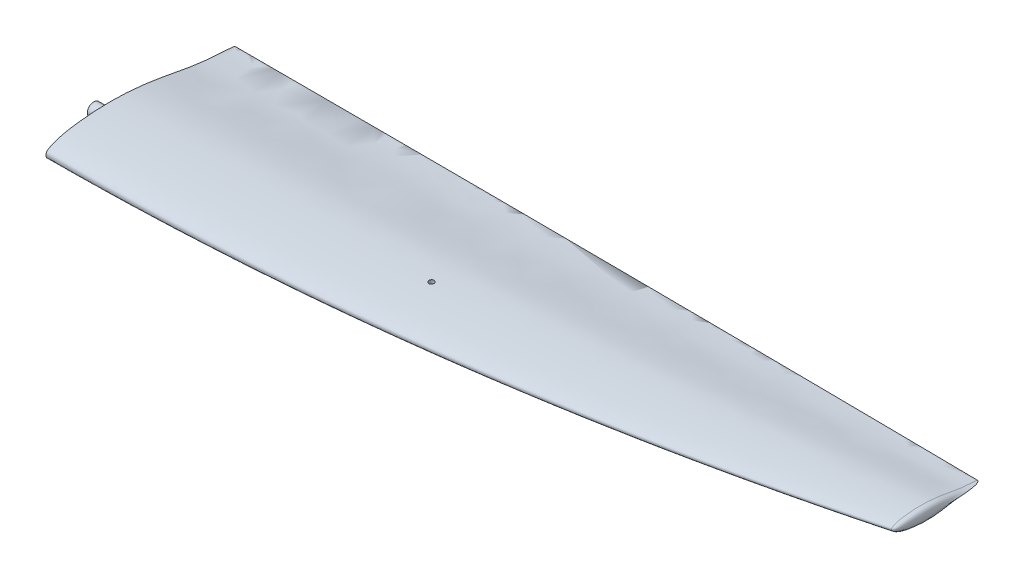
ISO-10303-21;
HEADER;
FILE_DESCRIPTION(('STEP AP214'),'2;1');
FILE_NAME('part.step','',(''),(''),'','','');
FILE_SCHEMA(('AUTOMOTIVE_DESIGN { 1 0 10303 214 1 1 1 1 }'));
ENDSEC;
DATA;
#1=APPLICATION_CONTEXT('core data for automotive mechanical design processes');
#2=APPLICATION_PROTOCOL_DEFINITION('international standard','automotive_design',2000,#1);
#3=PRODUCT_CONTEXT('',#1,'mechanical');
#4=PRODUCT('Part','Part','',(#3));
#5=PRODUCT_RELATED_PRODUCT_CATEGORY('part','',(#4));
#6=PRODUCT_DEFINITION_FORMATION('','',#4);
#7=PRODUCT_DEFINITION_CONTEXT('part definition',#1,'design');
#8=PRODUCT_DEFINITION('design','',#6,#7);
#9=PRODUCT_DEFINITION_SHAPE('','',#8);
#10=(LENGTH_UNIT() NAMED_UNIT(*) SI_UNIT(.MILLI.,.METRE.));
#11=(NAMED_UNIT(*) PLANE_ANGLE_UNIT() SI_UNIT($,.RADIAN.));
#12=(NAMED_UNIT(*) SI_UNIT($,.STERADIAN.) SOLID_ANGLE_UNIT());
#13=UNCERTAINTY_MEASURE_WITH_UNIT(LENGTH_MEASURE(1.E-05),#10,'distance_accuracy_value','');
#14=(GEOMETRIC_REPRESENTATION_CONTEXT(3) GLOBAL_UNCERTAINTY_ASSIGNED_CONTEXT((#13)) GLOBAL_UNIT_ASSIGNED_CONTEXT((#10,
#11,#12)) REPRESENTATION_CONTEXT('',''));
#15=CARTESIAN_POINT('',(0.,0.,0.));
#16=DIRECTION('',(0.,0.,1.));
#17=DIRECTION('',(1.,0.,0.));
#18=AXIS2_PLACEMENT_3D('',#15,#16,#17);
#19=CARTESIAN_POINT('',(0.,-2.15608748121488E-06,196.200000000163));
#20=CARTESIAN_POINT('',(475.,0.,196.2));
#21=CARTESIAN_POINT('',(950.,0.,133.633333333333));
#22=CARTESIAN_POINT('',(1425.,-9.80039763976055E-07,8.50000000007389));
#23=CARTESIAN_POINT('',(0.,-0.244265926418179,196.200018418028));
#24=CARTESIAN_POINT('',(475.,-0.199852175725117,196.200015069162));
#25=CARTESIAN_POINT('',(950.,-0.155440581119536,133.633345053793));
#26=CARTESIAN_POINT('',(1425.,-0.111029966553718,8.5000083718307));
#27=CARTESIAN_POINT('',(0.,-0.73285632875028,196.187251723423));
#28=CARTESIAN_POINT('',(475.,-0.599746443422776,196.188551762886));
#29=CARTESIAN_POINT('',(949.999999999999,-0.466506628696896,133.624183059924));
#30=CARTESIAN_POINT('',(1425.,-0.333135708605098,8.49414561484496));
#31=CARTESIAN_POINT('',(0.,-1.46321650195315,196.12381651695));
#32=CARTESIAN_POINT('',(474.999999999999,-1.19789958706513,196.132216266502));
#33=CARTESIAN_POINT('',(949.999999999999,-0.931861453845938,133.579414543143));
#34=CARTESIAN_POINT('',(1425.,-0.665100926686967,8.46541134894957));
#35=CARTESIAN_POINT('',(0.,-2.18798191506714,196.011833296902));
#36=CARTESIAN_POINT('',(475.000000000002,-1.79187154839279,196.033154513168));
#37=CARTESIAN_POINT('',(950.000000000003,-1.39405860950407,133.500688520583));
#38=CARTESIAN_POINT('',(1425.,-0.994541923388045,8.41443532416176));
#39=CARTESIAN_POINT('',(0.,-2.90255474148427,195.847987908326));
#40=CARTESIAN_POINT('',(474.999999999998,-2.377898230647,195.888782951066));
#41=CARTESIAN_POINT('',(949.999999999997,-1.85017082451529,133.386128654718));
#42=CARTESIAN_POINT('',(1424.99999999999,-1.31937134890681,8.34002502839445));
#43=CARTESIAN_POINT('',(0.,-3.602183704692,195.626401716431));
#44=CARTESIAN_POINT('',(475.000000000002,-2.95204984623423,195.694222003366));
#45=CARTESIAN_POINT('',(950.000000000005,-2.29709289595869,133.231831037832));
#46=CARTESIAN_POINT('',(1425.00000000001,-1.63731168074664,8.23922883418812));
#47=CARTESIAN_POINT('',(0.,-4.27737914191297,195.340801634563));
#48=CARTESIAN_POINT('',(474.999999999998,-3.50664389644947,195.444460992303));
#49=CARTESIAN_POINT('',(949.999999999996,-2.72895258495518,133.034024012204));
#50=CARTESIAN_POINT('',(1424.99999999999,-1.94430403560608,8.10949071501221));
#51=CARTESIAN_POINT('',(0.,-4.9187088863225,194.981276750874));
#52=CARTESIAN_POINT('',(475.000000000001,-4.03388907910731,195.131344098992));
#53=CARTESIAN_POINT('',(950.000000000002,-3.13960254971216,132.786283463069));
#54=CARTESIAN_POINT('',(1425.,-2.23584812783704,7.94609487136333));
#55=CARTESIAN_POINT('',(0.,-5.48662510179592,194.513718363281));
#56=CARTESIAN_POINT('',(475.,-4.50140936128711,194.726971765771));
#57=CARTESIAN_POINT('',(950.000000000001,-3.50384165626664,132.466895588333));
#58=CARTESIAN_POINT('',(1425.,-2.49392081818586,7.73348986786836));
#59=CARTESIAN_POINT('',(0.,-5.97803230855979,193.96886054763));
#60=CARTESIAN_POINT('',(474.999999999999,-4.90673538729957,194.256585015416));
#61=CARTESIAN_POINT('',(949.999999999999,-3.81982976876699,132.095584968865));
#62=CARTESIAN_POINT('',(1425.,-2.7173142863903,7.48586045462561));
#63=CARTESIAN_POINT('',(0.,-6.45598988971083,193.413845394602));
#64=CARTESIAN_POINT('',(475.000000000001,-5.30140660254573,193.775078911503));
#65=CARTESIAN_POINT('',(950.000000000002,-4.1275894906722,131.714976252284));
#66=CARTESIAN_POINT('',(1425.,-2.93453738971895,7.23353747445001));
#67=CARTESIAN_POINT('',(0.,-6.91818774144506,192.844817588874));
#68=CARTESIAN_POINT('',(475.,-5.68356560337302,193.279371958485));
#69=CARTESIAN_POINT('',(950.,-4.42571921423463,131.322738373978));
#70=CARTESIAN_POINT('',(1425.,-3.14464741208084,6.97491690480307));
#71=CARTESIAN_POINT('',(0.,-7.36609680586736,192.26493166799));
#72=CARTESIAN_POINT('',(474.999999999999,-6.05438467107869,192.772028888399));
#73=CARTESIAN_POINT('',(949.999999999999,-4.71509565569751,130.920822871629));
#74=CARTESIAN_POINT('',(1425.,-3.34822860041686,6.7113137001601));
#75=CARTESIAN_POINT('',(0.,-7.79885815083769,191.673406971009));
#76=CARTESIAN_POINT('',(475.000000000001,-6.41317749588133,192.252461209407));
#77=CARTESIAN_POINT('',(950.000000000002,-4.99520822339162,130.508810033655));
#78=CARTESIAN_POINT('',(1425.,-3.54494917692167,6.44245354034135));
#79=CARTESIAN_POINT('',(0.,-8.21694744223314,191.071561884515));
#80=CARTESIAN_POINT('',(475.,-6.76031409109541,191.721749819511));
#81=CARTESIAN_POINT('',(949.999999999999,-5.26632437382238,130.087519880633));
#82=CARTESIAN_POINT('',(1425.,-3.73497713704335,6.1688721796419));
#83=CARTESIAN_POINT('',(0.,-8.62014469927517,190.459573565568));
#84=CARTESIAN_POINT('',(475.,-7.09562954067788,191.180085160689));
#85=CARTESIAN_POINT('',(950.,-5.52833735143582,129.657132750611));
#86=CARTESIAN_POINT('',(1425.,-3.9182669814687,5.890716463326));
#87=CARTESIAN_POINT('',(0.,-9.1381669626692,189.631064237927));
#88=CARTESIAN_POINT('',(475.000000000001,-7.527152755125,190.444074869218));
#89=CARTESIAN_POINT('',(950.000000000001,-5.86566753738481,129.071750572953));
#90=CARTESIAN_POINT('',(1425.,-4.15371016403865,5.51409150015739));
#91=CARTESIAN_POINT('',(0.,-9.7488602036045,188.573006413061));
#92=CARTESIAN_POINT('',(474.999999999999,-8.03730319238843,189.499189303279));
#93=CARTESIAN_POINT('',(949.999999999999,-6.2647908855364,128.319247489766));
#94=CARTESIAN_POINT('',(1425.,-4.4313221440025,5.03318115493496));
#95=CARTESIAN_POINT('',(0.,-10.4280939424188,187.274005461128));
#96=CARTESIAN_POINT('',(475.,-8.60697243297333,188.331019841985));
#97=CARTESIAN_POINT('',(950.000000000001,-6.71095235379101,127.387252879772));
#98=CARTESIAN_POINT('',(1425.,-4.74003257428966,4.44270479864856));
#99=CARTESIAN_POINT('',(0.,-11.0600429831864,185.951420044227));
#100=CARTESIAN_POINT('',(475.,-9.1393167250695,187.133464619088));
#101=CARTESIAN_POINT('',(950.,-7.12841125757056,126.430175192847));
#102=CARTESIAN_POINT('',(1425.,-5.0273254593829,3.84155203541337));
#103=CARTESIAN_POINT('',(0.,-11.6512302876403,184.610203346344));
#104=CARTESIAN_POINT('',(475.,-9.63958363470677,185.910730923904));
#105=CARTESIAN_POINT('',(950.,-7.52116453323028,125.451288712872));
#106=CARTESIAN_POINT('',(1425.,-5.29597187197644,3.2318770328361));
#107=CARTESIAN_POINT('',(0.,-12.2087655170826,183.254696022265));
#108=CARTESIAN_POINT('',(475.,-10.113674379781,184.666602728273));
#109=CARTESIAN_POINT('',(950.,-7.8939297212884,124.453633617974));
#110=CARTESIAN_POINT('',(1425.,-5.54953044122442,2.61578906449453));
#111=CARTESIAN_POINT('',(0.,-12.7392846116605,181.888438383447));
#112=CARTESIAN_POINT('',(475.,-10.5668067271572,183.404091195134));
#113=CARTESIAN_POINT('',(949.999999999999,-8.25053118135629,123.439504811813));
#114=CARTESIAN_POINT('',(1425.,-5.7904568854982,1.99467966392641));
#115=CARTESIAN_POINT('',(0.,-13.2506974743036,180.514938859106));
#116=CARTESIAN_POINT('',(475.,-11.0057189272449,182.126364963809));
#117=CARTESIAN_POINT('',(950.,-8.59656027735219,122.411544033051));
#118=CARTESIAN_POINT('',(1425.,-6.02322044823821,1.37047655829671));
#119=CARTESIAN_POINT('',(0.,-13.7467868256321,179.135835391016));
#120=CARTESIAN_POINT('',(475.,-11.4331189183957,180.834813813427));
#121=CARTESIAN_POINT('',(950.000000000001,-8.93367493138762,121.370705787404));
#122=CARTESIAN_POINT('',(1425.,-6.24845380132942,0.743511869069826));
#123=CARTESIAN_POINT('',(0.,-14.2269935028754,177.751118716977));
#124=CARTESIAN_POINT('',(475.,-11.848820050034,179.52972938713));
#125=CARTESIAN_POINT('',(950.,-9.26208577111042,120.317395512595));
#126=CARTESIAN_POINT('',(1425.,-6.46678961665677,0.114117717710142));
#127=CARTESIAN_POINT('',(0.,-14.8470154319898,175.89793437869));
#128=CARTESIAN_POINT('',(475.,-12.3880706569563,177.772249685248));
#129=CARTESIAN_POINT('',(950.,-9.68863338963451,118.896868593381));
#130=CARTESIAN_POINT('',(1425.,-6.74870259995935,-0.728208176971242));
#131=CARTESIAN_POINT('',(0.,-15.5845051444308,173.56912187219));
#132=CARTESIAN_POINT('',(475.,-13.0342030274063,175.543768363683));
#133=CARTESIAN_POINT('',(950.,-10.2006457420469,117.091796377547));
#134=CARTESIAN_POINT('',(1425.,-7.0838322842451,-1.78679323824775));
#135=CARTESIAN_POINT('',(0.,-16.4123940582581,170.757127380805));
#136=CARTESIAN_POINT('',(475.,-13.7672600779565,172.822427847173));
#137=CARTESIAN_POINT('',(949.999999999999,-10.7831968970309,114.881734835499));
#138=CARTESIAN_POINT('',(1425.,-7.4602035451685,-3.06495063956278));
#139=CARTESIAN_POINT('',(0.,-17.1860119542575,167.929734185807));
#140=CARTESIAN_POINT('',(475.,-14.4600450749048,170.057042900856));
#141=CARTESIAN_POINT('',(950.,-11.3353142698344,112.630417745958));
#142=CARTESIAN_POINT('',(1425.,-7.8118186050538,-4.35014008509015));
#143=CARTESIAN_POINT('',(0.,-17.9084185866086,165.088843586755));
#144=CARTESIAN_POINT('',(475.,-15.1149067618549,167.250682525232));
#145=CARTESIAN_POINT('',(950.,-11.8588337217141,110.340584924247));
#146=CARTESIAN_POINT('',(1425.,-8.14019857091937,-5.64144783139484));
#147=CARTESIAN_POINT('',(0.,-18.5826951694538,162.236159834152));
#148=CARTESIAN_POINT('',(475.,-15.7341468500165,164.406229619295));
#149=CARTESIAN_POINT('',(950.,-12.3554755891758,108.014801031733));
#150=CARTESIAN_POINT('',(1425.,-8.44668053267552,-6.93812434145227));
#151=CARTESIAN_POINT('',(0.,-19.2120174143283,159.373238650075));
#152=CARTESIAN_POINT('',(475.,-16.3201758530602,161.526458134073));
#153=CARTESIAN_POINT('',(950.000000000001,-12.8270833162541,105.655561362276));
#154=CARTESIAN_POINT('',(1425.,-8.73273899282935,-8.23944986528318));
#155=CARTESIAN_POINT('',(0.,-19.7995818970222,156.501467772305));
#156=CARTESIAN_POINT('',(475.,-16.8754062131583,158.61399802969));
#157=CARTESIAN_POINT('',(949.999999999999,-13.2754833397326,103.26524121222));
#158=CARTESIAN_POINT('',(1425.,-8.99981251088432,-9.54480065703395));
#159=CARTESIAN_POINT('',(0.,-20.3486261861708,153.622098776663));
#160=CARTESIAN_POINT('',(475.,-17.4022900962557,155.671371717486));
#161=CARTESIAN_POINT('',(950.,-13.7025405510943,100.846136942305));
#162=CARTESIAN_POINT('',(1425.,-9.24937683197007,-10.8536032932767));
#163=CARTESIAN_POINT('',(0.,-20.8623856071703,150.736230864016));
#164=CARTESIAN_POINT('',(475.,-17.9032777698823,152.700974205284));
#165=CARTESIAN_POINT('',(950.,-14.1101182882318,98.4004424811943));
#166=CARTESIAN_POINT('',(1425.,-9.48290649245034,-12.1653618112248));
#167=CARTESIAN_POINT('',(0.,-21.3441238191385,147.844863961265));
#168=CARTESIAN_POINT('',(475.,-18.380837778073,149.705121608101));
#169=CARTESIAN_POINT('',(950.,-14.5000881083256,95.930293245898));
#170=CARTESIAN_POINT('',(1425.,-9.70187419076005,-13.4796183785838));
#171=CARTESIAN_POINT('',(0.,-21.948047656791,143.983498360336));
#172=CARTESIAN_POINT('',(475.,-18.9896086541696,145.679622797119));
#173=CARTESIAN_POINT('',(950.,-14.9990558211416,92.6068593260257));
#174=CARTESIAN_POINT('',(1425.,-9.97638860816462,-15.2347889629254));
#175=CARTESIAN_POINT('',(0.,-22.6391576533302,139.147175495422));
#176=CARTESIAN_POINT('',(475.,-19.7043180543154,140.594978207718));
#177=CARTESIAN_POINT('',(950.,-15.5881080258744,88.4015472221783));
#178=CARTESIAN_POINT('',(1425.,-10.2905271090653,-17.4331139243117));
#179=CARTESIAN_POINT('',(0.,-23.3921416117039,133.333242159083));
#180=CARTESIAN_POINT('',(475.,-20.5074292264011,134.425062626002));
#181=CARTESIAN_POINT('',(949.999999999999,-16.2543133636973,83.2887098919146));
#182=CARTESIAN_POINT('',(1425.,-10.6327936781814,-20.0758119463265));
#183=CARTESIAN_POINT('',(0.,-24.0698675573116,127.51004146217));
#184=CARTESIAN_POINT('',(475.,-21.2553050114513,128.199665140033));
#185=CARTESIAN_POINT('',(950.,-16.878965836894,78.122076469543));
#186=CARTESIAN_POINT('',(1425.,-10.9408498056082,-22.722719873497));
#187=CARTESIAN_POINT('',(0.,-24.6736752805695,121.678727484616));
#188=CARTESIAN_POINT('',(474.999999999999,-21.9474578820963,121.931703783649));
#189=CARTESIAN_POINT('',(949.999999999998,-17.4613356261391,72.9143538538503));
#190=CARTESIAN_POINT('',(1425.,-11.2153084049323,-25.3733170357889));
#191=CARTESIAN_POINT('',(0.,-25.2049047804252,115.840353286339));
#192=CARTESIAN_POINT('',(475.000000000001,-22.5833980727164,115.634015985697));
#193=CARTESIAN_POINT('',(950.000000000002,-18.0006882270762,67.6781887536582));
#194=CARTESIAN_POINT('',(1425.,-11.4567752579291,-28.0271225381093));
#195=CARTESIAN_POINT('',(0.,-25.6649677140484,109.995948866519));
#196=CARTESIAN_POINT('',(474.999999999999,-23.1626968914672,109.319419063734));
#197=CARTESIAN_POINT('',(949.999999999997,-18.4963396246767,62.4262107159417));
#198=CARTESIAN_POINT('',(1425.,-11.6658960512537,-30.6836696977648));
#199=CARTESIAN_POINT('',(0.,-26.0553535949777,104.146479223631));
#200=CARTESIAN_POINT('',(475.000000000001,-23.6849858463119,103.000678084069));
#201=CARTESIAN_POINT('',(950.000000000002,-18.947648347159,57.1710097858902));
#202=CARTESIAN_POINT('',(1425.,-11.8433413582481,-33.3425185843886));
#203=CARTESIAN_POINT('',(0.,-26.3775224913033,98.2928632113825));
#204=CARTESIAN_POINT('',(474.999999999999,-24.1498785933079,96.6905196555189));
#205=CARTESIAN_POINT('',(949.999999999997,-19.3539666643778,51.9251452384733));
#206=CARTESIAN_POINT('',(1425.,-11.9897870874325,-36.0032523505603));
#207=CARTESIAN_POINT('',(0.,-26.6331381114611,92.4359662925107));
#208=CARTESIAN_POINT('',(475.,-24.5571435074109,90.401627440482));
#209=CARTESIAN_POINT('',(950.,-19.7147526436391,46.7011438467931));
#210=CARTESIAN_POINT('',(1425.,-12.105966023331,-38.6654762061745));
#211=CARTESIAN_POINT('',(0.,-26.8235064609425,86.5765917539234));
#212=CARTESIAN_POINT('',(474.999999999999,-24.9062775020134,84.1466321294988));
#213=CARTESIAN_POINT('',(949.999999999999,-20.0292791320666,41.5114886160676));
#214=CARTESIAN_POINT('',(1425.,-12.192511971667,-41.3288299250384));
#215=CARTESIAN_POINT('',(0.,-26.947943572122,80.7154330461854));
#216=CARTESIAN_POINT('',(474.999999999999,-25.1951169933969,77.938079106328));
#217=CARTESIAN_POINT('',(949.999999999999,-20.2954879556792,36.3686017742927));
#218=CARTESIAN_POINT('',(1425.,-12.2490571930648,-43.99298952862));
#219=CARTESIAN_POINT('',(0.,-27.0250262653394,72.899192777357));
#220=CARTESIAN_POINT('',(475.,-25.4969999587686,69.7387258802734));
#221=CARTESIAN_POINT('',(949.999999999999,-20.5833606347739,29.5903823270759));
#222=CARTESIAN_POINT('',(1425.,-12.284109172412,-47.5458277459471));
#223=CARTESIAN_POINT('',(0.,-26.953627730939,63.1281535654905));
#224=CARTESIAN_POINT('',(475.,-25.7133172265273,59.6685579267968));
#225=CARTESIAN_POINT('',(950.,-20.8126558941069,21.2967677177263));
#226=CARTESIAN_POINT('',(1425.,-12.2516447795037,-51.9872061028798));
#227=CARTESIAN_POINT('',(0.,-26.5937450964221,51.4081246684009));
#228=CARTESIAN_POINT('',(474.999999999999,-25.697834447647,47.9718273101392));
#229=CARTESIAN_POINT('',(949.999999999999,-20.8626084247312,11.7309510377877));
#230=CARTESIAN_POINT('',(1425.,-12.0880682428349,-57.3144923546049));
#231=CARTESIAN_POINT('',(0.,-25.9553973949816,39.6998770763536));
#232=CARTESIAN_POINT('',(475.,-25.3911119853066,36.7637406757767));
#233=CARTESIAN_POINT('',(950.,-20.6719476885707,2.65163745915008));
#234=CARTESIAN_POINT('',(1425.,-11.7979058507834,-62.6364201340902));
#235=CARTESIAN_POINT('',(0.,-25.0310654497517,28.0107749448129));
#236=CARTESIAN_POINT('',(475.,-24.7743243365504,26.1461213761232));
#237=CARTESIAN_POINT('',(950.,-20.2232220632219,-5.84069118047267));
#238=CARTESIAN_POINT('',(1425.,-11.3777600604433,-67.949649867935));
#239=CARTESIAN_POINT('',(0.,-24.2397907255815,20.2339886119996));
#240=CARTESIAN_POINT('',(475.,-24.1607306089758,19.5278283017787));
#241=CARTESIAN_POINT('',(950.,-19.7534954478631,-11.0450224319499));
#242=CARTESIAN_POINT('',(1425.,-11.0180866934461,-71.4845506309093));
#243=CARTESIAN_POINT('',(0.,-23.3839785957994,12.5899250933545));
#244=CARTESIAN_POINT('',(475.,-23.4605206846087,13.2735945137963));
#245=CARTESIAN_POINT('',(950.,-19.2088877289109,-15.9094264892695));
#246=CARTESIAN_POINT('',(1425.,-10.6290811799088,-74.9591249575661));
#247=CARTESIAN_POINT('',(0.,-22.4682801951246,5.07807437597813));
#248=CARTESIAN_POINT('',(475.000000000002,-22.6775039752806,6.87206551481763));
#249=CARTESIAN_POINT('',(950.000000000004,-18.5923665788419,-20.945164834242));
#250=CARTESIAN_POINT('',(1425.,-10.2128694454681,-78.3736038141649));
#251=CARTESIAN_POINT('',(0.,-20.8978746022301,-6.1638587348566));
#252=CARTESIAN_POINT('',(475.000000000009,-21.2531338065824,-3.3796872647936));
#253=CARTESIAN_POINT('',(950.000000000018,-17.4535140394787,-29.1529279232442));
#254=CARTESIAN_POINT('',(1425.,-9.49901669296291,-83.4835682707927));
#255=CARTESIAN_POINT('',(0.,-19.1519507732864,-17.3797789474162));
#256=CARTESIAN_POINT('',(475.000000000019,-19.6091004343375,-14.1849656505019));
#257=CARTESIAN_POINT('',(950.000000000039,-16.1269345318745,-37.9189500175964));
#258=CARTESIAN_POINT('',(1425.,-8.70545438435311,-88.581720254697));
#259=CARTESIAN_POINT('',(0.,-17.5753317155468,-26.7065230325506));
#260=CARTESIAN_POINT('',(475.00000000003,-18.0866605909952,-23.572285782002));
#261=CARTESIAN_POINT('',(950.00000000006,-14.8911442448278,-45.6104972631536));
#262=CARTESIAN_POINT('',(1425.,-7.98878391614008,-92.8211463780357));
#263=CARTESIAN_POINT('',(0.,-16.263222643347,-34.1590320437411));
#264=CARTESIAN_POINT('',(475.000000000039,-16.8017823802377,-31.2664741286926));
#265=CARTESIAN_POINT('',(950.000000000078,-13.8448335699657,-51.9496840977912));
#266=CARTESIAN_POINT('',(1425.,-7.39237737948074,-96.2086514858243));
#267=CARTESIAN_POINT('',(0.,-15.2583077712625,-39.7447171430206));
#268=CARTESIAN_POINT('',(475.000000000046,-15.8099812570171,-37.1179162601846));
#269=CARTESIAN_POINT('',(950.000000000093,-13.0357438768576,-56.7855468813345));
#270=CARTESIAN_POINT('',(1425.,-6.93559673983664,-98.7475990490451));
#271=CARTESIAN_POINT('',(0.,-14.2380766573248,-45.3276111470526));
#272=CARTESIAN_POINT('',(475.000000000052,-14.7961370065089,-43.0389251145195));
#273=CARTESIAN_POINT('',(950.000000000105,-12.2073943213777,-61.6914835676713));
#274=CARTESIAN_POINT('',(1425.,-6.47184964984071,-101.285277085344));
#275=CARTESIAN_POINT('',(0.,-13.2075564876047,-50.9086189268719));
#276=CARTESIAN_POINT('',(475.000000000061,-13.7659539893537,-49.0182670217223));
#277=CARTESIAN_POINT('',(950.000000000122,-11.3645814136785,-66.6560970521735));
#278=CARTESIAN_POINT('',(1425.,-6.00343974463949,-103.822100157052));
#279=CARTESIAN_POINT('',(0.,-12.1716820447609,-56.4886306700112));
#280=CARTESIAN_POINT('',(475.000000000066,-12.7250429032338,-55.0446931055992));
#281=CARTESIAN_POINT('',(950.000000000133,-10.5120067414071,-71.6679745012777));
#282=CARTESIAN_POINT('',(1425.,-5.53257447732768,-106.358466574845));
#283=CARTESIAN_POINT('',(0.,-11.1361417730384,-62.068706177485));
#284=CARTESIAN_POINT('',(475.000000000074,-11.6796623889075,-61.1070989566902));
#285=CARTESIAN_POINT('',(950.000000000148,-9.65491411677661,-76.7158224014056));
#286=CARTESIAN_POINT('',(1425.,-5.06189780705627,-108.894868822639));
#287=CARTESIAN_POINT('',(0.,-10.1046087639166,-67.6495237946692));
#288=CARTESIAN_POINT('',(475.00000000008,-10.6343684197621,-67.1940580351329));
#289=CARTESIAN_POINT('',(950.00000000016,-8.79715737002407,-81.7880844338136));
#290=CARTESIAN_POINT('',(1425.,-4.59297639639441,-111.431595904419));
#291=CARTESIAN_POINT('',(0.,-9.08698549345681,-73.2329050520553));
#292=CARTESIAN_POINT('',(475.000000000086,-9.59890016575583,-73.295095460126));
#293=CARTESIAN_POINT('',(950.000000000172,-7.94672733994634,-86.8739644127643));
#294=CARTESIAN_POINT('',(1425.,-4.13046772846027,-113.969505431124));
#295=CARTESIAN_POINT('',(0.,-8.10599658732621,-78.8228820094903));
#296=CARTESIAN_POINT('',(475.000000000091,-8.59338060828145,-79.4015243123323));
#297=CARTESIAN_POINT('',(950.000000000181,-7.11956033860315,-91.9640315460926));
#298=CARTESIAN_POINT('',(1425.,-3.68453642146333,-116.51039783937));
#299=CARTESIAN_POINT('',(0.,-7.18133162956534,-84.4224935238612));
#300=CARTESIAN_POINT('',(475.000000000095,-7.63554028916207,-85.5038635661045));
#301=CARTESIAN_POINT('',(950.00000000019,-6.32984284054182,-97.0482600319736));
#302=CARTESIAN_POINT('',(1425.,-3.26423985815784,-119.055677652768));
#303=CARTESIAN_POINT('',(0.,-6.33568875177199,-90.0346905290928));
#304=CARTESIAN_POINT('',(475.000000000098,-6.74552618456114,-91.592549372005));
#305=CARTESIAN_POINT('',(950.000000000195,-5.59358564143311,-102.116546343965));
#306=CARTESIAN_POINT('',(1425.,-2.87986762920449,-121.606676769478));
#307=CARTESIAN_POINT('',(0.,-5.71444884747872,-94.7233594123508));
#308=CARTESIAN_POINT('',(475.0000000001,-6.07608441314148,-96.6462008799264));
#309=CARTESIAN_POINT('',(950.0000000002,-5.03708621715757,-106.317711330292));
#310=CARTESIAN_POINT('',(1425.,-2.59745471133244,-123.737886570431));
#311=CARTESIAN_POINT('',(0.,-5.26260031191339,-98.4798664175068));
#312=CARTESIAN_POINT('',(475.000000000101,-5.58066029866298,-100.669734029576));
#313=CARTESIAN_POINT('',(950.000000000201,-4.62383184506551,-109.658245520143));
#314=CARTESIAN_POINT('',(1425.,-2.3921153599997,-125.445397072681));
#315=CARTESIAN_POINT('',(0.,-4.94510583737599,-101.299747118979));
#316=CARTESIAN_POINT('',(475.000000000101,-5.22835752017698,-103.675954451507));
#317=CARTESIAN_POINT('',(950.000000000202,-4.32924660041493,-112.151758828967));
#318=CARTESIAN_POINT('',(1425.,-2.24777345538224,-126.727156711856));
#319=CARTESIAN_POINT('',(0.,-4.64743402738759,-104.121779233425));
#320=CARTESIAN_POINT('',(475.000000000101,-4.89426104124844,-106.668967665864));
#321=CARTESIAN_POINT('',(950.000000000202,-4.04927000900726,-114.631675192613));
#322=CARTESIAN_POINT('',(1425.,-2.11246127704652,-128.009898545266));
#323=CARTESIAN_POINT('',(0.,-4.36814614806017,-106.945691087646));
#324=CARTESIAN_POINT('',(475.000000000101,-4.57738094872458,-109.647053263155));
#325=CARTESIAN_POINT('',(950.000000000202,-3.78316285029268,-117.096322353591));
#326=CARTESIAN_POINT('',(1425.,-1.98549216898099,-129.29349535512));
#327=CARTESIAN_POINT('',(0.,-4.10548994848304,-109.77119425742));
#328=CARTESIAN_POINT('',(475.0000000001,-4.27651831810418,-112.608479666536));
#329=CARTESIAN_POINT('',(950.0000000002,-3.53008139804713,-119.544022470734));
#330=CARTESIAN_POINT('',(1425.,-1.86617947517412,-130.577819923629));
#331=CARTESIAN_POINT('',(0.,-3.85806412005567,-112.598070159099));
#332=CARTESIAN_POINT('',(475.000000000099,-3.9906357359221,-115.551565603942));
#333=CARTESIAN_POINT('',(950.000000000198,-3.28915400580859,-121.973128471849));
#334=CARTESIAN_POINT('',(1425.,-1.75361918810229,-131.862756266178));
#335=CARTESIAN_POINT('',(0.,-3.62312816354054,-115.426007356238));
#336=CARTESIAN_POINT('',(475.000000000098,-3.71780299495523,-118.474567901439));
#337=CARTESIAN_POINT('',(950.000000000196,-3.05906263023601,-124.381962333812));
#338=CARTESIAN_POINT('',(1425.,-1.64690730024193,-133.148188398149));
#339=CARTESIAN_POINT('',(0.,-3.39748768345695,-118.254699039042));
#340=CARTESIAN_POINT('',(475.000000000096,-3.45550579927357,-121.375730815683));
#341=CARTESIAN_POINT('',(950.000000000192,-2.83777494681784,-126.768816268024));
#342=CARTESIAN_POINT('',(1425.,-1.54429533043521,-134.433953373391));
#343=CARTESIAN_POINT('',(0.,-3.17840314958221,-121.083904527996));
#344=CARTESIAN_POINT('',(475.000000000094,-3.20176740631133,-124.253365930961));
#345=CARTESIAN_POINT('',(950.000000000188,-2.62387887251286,-129.132051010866));
#346=CARTESIAN_POINT('',(1425.,-1.44473772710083,-135.719957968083));
#347=CARTESIAN_POINT('',(0.,-2.96317918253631,-123.913405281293));
#348=CARTESIAN_POINT('',(475.000000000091,-2.95454255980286,-127.105794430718));
#349=CARTESIAN_POINT('',(950.000000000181,-2.41578114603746,-131.470024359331));
#350=CARTESIAN_POINT('',(1425.,-1.3468950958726,-137.006093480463));
#351=CARTESIAN_POINT('',(0.,-2.74883863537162,-126.742972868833));
#352=CARTESIAN_POINT('',(475.000000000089,-2.71161342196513,-129.931334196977));
#353=CARTESIAN_POINT('',(950.000000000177,-2.21182511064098,-133.781097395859));
#354=CARTESIAN_POINT('',(1425.,-1.2494738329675,-138.292261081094));
#355=CARTESIAN_POINT('',(0.,-2.53247144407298,-129.572386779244));
#356=CARTESIAN_POINT('',(475.000000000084,-2.47078794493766,-132.72830708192));
#357=CARTESIAN_POINT('',(950.000000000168,-2.01033860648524,-136.063631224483));
#358=CARTESIAN_POINT('',(1425.,-1.15112353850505,-139.578358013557));
#359=CARTESIAN_POINT('',(0.,-2.30963481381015,-132.401301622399));
#360=CARTESIAN_POINT('',(475.000000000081,-2.22863160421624,-135.494933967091));
#361=CARTESIAN_POINT('',(950.000000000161,-1.80869725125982,-138.315909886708));
#362=CARTESIAN_POINT('',(1425.,-1.04983184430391,-140.864228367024));
#363=CARTESIAN_POINT('',(0.,-2.11591467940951,-134.758084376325));
#364=CARTESIAN_POINT('',(475.000000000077,-2.02374025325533,-137.773732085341));
#365=CARTESIAN_POINT('',(950.000000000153,-1.63902968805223,-140.166202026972));
#366=CARTESIAN_POINT('',(1425.,-0.961783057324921,-141.935493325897));
#367=CARTESIAN_POINT('',(0.,-1.96157429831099,-136.643559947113));
#368=CARTESIAN_POINT('',(475.000000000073,-1.86252070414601,-139.580344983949));
#369=CARTESIAN_POINT('',(950.000000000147,-1.50586756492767,-141.630000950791));
#370=CARTESIAN_POINT('',(1425.,-0.891614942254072,-142.79252707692));
#371=CARTESIAN_POINT('',(0.,-1.84713416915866,-138.057774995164));
#372=CARTESIAN_POINT('',(475.000000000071,-1.74380648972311,-140.9269738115));
#373=CARTESIAN_POINT('',(950.000000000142,-1.40796723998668,-142.719500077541));
#374=CARTESIAN_POINT('',(1425.,-0.839616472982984,-143.435353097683));
#375=CARTESIAN_POINT('',(0.,-1.73523818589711,-139.472193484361));
#376=CARTESIAN_POINT('',(475.000000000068,-1.62830086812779,-142.265161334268));
#377=CARTESIAN_POINT('',(950.000000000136,-1.31280071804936,-143.800520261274));
#378=CARTESIAN_POINT('',(1425.,-0.788737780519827,-144.078269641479));
#379=CARTESIAN_POINT('',(0.,-1.62661296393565,-140.886867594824));
#380=CARTESIAN_POINT('',(475.000000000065,-1.51664453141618,-143.594764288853));
#381=CARTESIAN_POINT('',(950.00000000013,-1.22089800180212,-144.872909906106));
#382=CARTESIAN_POINT('',(1425.,-0.739373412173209,-144.721303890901));
#383=CARTESIAN_POINT('',(0.,-1.52187595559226,-142.301835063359));
#384=CARTESIAN_POINT('',(475.000000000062,-1.40935263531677,-144.915625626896));
#385=CARTESIAN_POINT('',(950.000000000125,-1.13264718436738,-145.936504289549));
#386=CARTESIAN_POINT('',(1425.,-0.691759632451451,-145.364470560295));
#387=CARTESIAN_POINT('',(0.,-1.42130065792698,-143.717104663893));
#388=CARTESIAN_POINT('',(475.000000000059,-1.30668243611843,-146.227565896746));
#389=CARTESIAN_POINT('',(950.000000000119,-1.04826451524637,-146.991122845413));
#390=CARTESIAN_POINT('',(1425.,-0.646046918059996,-146.007775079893));
#391=CARTESIAN_POINT('',(0.,-1.32502042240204,-145.13267285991));
#392=CARTESIAN_POINT('',(475.000000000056,-1.20876296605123,-147.530394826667));
#393=CARTESIAN_POINT('',(950.000000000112,-0.967849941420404,-148.036575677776));
#394=CARTESIAN_POINT('',(1425.,-0.602281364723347,-146.651215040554));
#395=CARTESIAN_POINT('',(0.,-1.23295970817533,-146.548521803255));
#396=CARTESIAN_POINT('',(475.000000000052,-1.11555982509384,-148.823910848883));
#397=CARTESIAN_POINT('',(950.000000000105,-0.891385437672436,-149.072664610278));
#398=CARTESIAN_POINT('',(1425.,-0.56043655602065,-147.294782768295));
#399=CARTESIAN_POINT('',(0.,-1.14502118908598,-147.964632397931));
#400=CARTESIAN_POINT('',(475.000000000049,-1.02701673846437,-150.107911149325));
#401=CARTESIAN_POINT('',(950.000000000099,-0.818831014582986,-150.099190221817));
#402=CARTESIAN_POINT('',(1425.,-0.520464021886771,-147.938469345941));
#403=CARTESIAN_POINT('',(0.,-1.06091209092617,-149.380975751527));
#404=CARTESIAN_POINT('',(475.000000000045,-0.942919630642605,-151.382185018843));
#405=CARTESIAN_POINT('',(950.00000000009,-0.750026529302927,-151.115947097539));
#406=CARTESIAN_POINT('',(1425.,-0.482232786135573,-148.582261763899));
#407=CARTESIAN_POINT('',(0.,-0.980598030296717,-150.79753883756));
#408=CARTESIAN_POINT('',(475.000000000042,-0.863264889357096,-152.646534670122));
#409=CARTESIAN_POINT('',(950.000000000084,-0.684974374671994,-152.122739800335));
#410=CARTESIAN_POINT('',(1425.,-0.445726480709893,-149.226154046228));
#411=CARTESIAN_POINT('',(0.,-0.902645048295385,-152.214233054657));
#412=CARTESIAN_POINT('',(475.000000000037,-0.786903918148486,-153.900700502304));
#413=CARTESIAN_POINT('',(950.000000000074,-0.622786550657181,-153.119324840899));
#414=CARTESIAN_POINT('',(1425.,-0.410292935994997,-149.870105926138));
#415=CARTESIAN_POINT('',(0.,-0.838292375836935,-153.394844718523));
#416=CARTESIAN_POINT('',(475.000000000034,-0.724923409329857,-154.937133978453));
#417=CARTESIAN_POINT('',(950.000000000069,-0.572506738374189,-153.941101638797));
#418=CARTESIAN_POINT('',(1425.,-0.381042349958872,-150.406747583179));
#419=CARTESIAN_POINT('',(0.,-0.786574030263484,-154.339321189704));
#420=CARTESIAN_POINT('',(475.000000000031,-0.675850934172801,-155.760937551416));
#421=CARTESIAN_POINT('',(950.000000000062,-0.532837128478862,-154.593182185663));
#422=CARTESIAN_POINT('',(1425.,-0.357532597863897,-150.836054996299));
#423=CARTESIAN_POINT('',(0.,-0.747479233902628,-155.047661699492));
#424=CARTESIAN_POINT('',(475.000000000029,-0.639153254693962,-156.376086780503));
#425=CARTESIAN_POINT('',(950.000000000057,-0.503248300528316,-155.079542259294));
#426=CARTESIAN_POINT('',(1425.,-0.33976435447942,-151.158028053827));
#427=CARTESIAN_POINT('',(0.,-0.707915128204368,-155.755976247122));
#428=CARTESIAN_POINT('',(475.000000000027,-0.602429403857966,-156.988501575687));
#429=CARTESIAN_POINT('',(950.000000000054,-0.473717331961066,-155.563172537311));
#430=CARTESIAN_POINT('',(1425.,-0.321778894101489,-151.479989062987));
#431=CARTESIAN_POINT('',(0.,-0.667674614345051,-156.464252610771));
#432=CARTESIAN_POINT('',(475.000000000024,-0.565515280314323,-157.598148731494));
#433=CARTESIAN_POINT('',(950.000000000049,-0.444120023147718,-156.04404221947));
#434=CARTESIAN_POINT('',(1425.,-0.303488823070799,-151.801933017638));
#435=CARTESIAN_POINT('',(0.,-0.626530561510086,-157.172477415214));
#436=CARTESIAN_POINT('',(475.000000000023,-0.528226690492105,-158.204993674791));
#437=CARTESIAN_POINT('',(950.000000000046,-0.414312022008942,-156.522118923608));
#438=CARTESIAN_POINT('',(1425.,-0.284786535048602,-152.123853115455));
#439=CARTESIAN_POINT('',(0.,-0.584201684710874,-157.880631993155));
#440=CARTESIAN_POINT('',(475.00000000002,-0.490337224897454,-158.808998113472));
#441=CARTESIAN_POINT('',(950.000000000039,-0.384118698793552,-156.997368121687));
#442=CARTESIAN_POINT('',(1425.,-0.265546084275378,-152.445741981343));
#443=CARTESIAN_POINT('',(0.,-0.540333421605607,-158.588694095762));
#444=CARTESIAN_POINT('',(475.000000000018,-0.45155995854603,-159.410119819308));
#445=CARTESIAN_POINT('',(950.000000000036,-0.35331767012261,-157.469750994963));
#446=CARTESIAN_POINT('',(1425.,-0.245606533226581,-152.767587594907));
#447=CARTESIAN_POINT('',(0.,-0.494460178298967,-159.296627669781));
#448=CARTESIAN_POINT('',(475.000000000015,-0.411516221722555,-160.008307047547));
#449=CARTESIAN_POINT('',(950.000000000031,-0.321614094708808,-157.939223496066));
#450=CARTESIAN_POINT('',(1425.,-0.224753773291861,-153.089376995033));
#451=CARTESIAN_POINT('',(0.,-0.445919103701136,-160.004387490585));
#452=CARTESIAN_POINT('',(475.000000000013,-0.369668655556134,-160.603497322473));
#453=CARTESIAN_POINT('',(950.000000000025,-0.28859301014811,-158.405729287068));
#454=CARTESIAN_POINT('',(1425.,-0.202692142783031,-153.411083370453));
#455=CARTESIAN_POINT('',(0.,-0.402438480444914,-160.593967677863));
#456=CARTESIAN_POINT('',(475.000000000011,-0.332632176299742,-161.0969142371));
#457=CARTESIAN_POINT('',(950.000000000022,-0.25946083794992,-158.791951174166));
#458=CARTESIAN_POINT('',(1425.,-0.182924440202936,-153.679078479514));
#459=CARTESIAN_POINT('',(0.,-0.365021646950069,-161.065438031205));
#460=CARTESIAN_POINT('',(475.000000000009,-0.301043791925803,-161.490036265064));
#461=CARTESIAN_POINT('',(950.000000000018,-0.234677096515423,-159.099349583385));
#462=CARTESIAN_POINT('',(1425.,-0.16592153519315,-153.893377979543));
#463=CARTESIAN_POINT('',(0.,-0.335292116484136,-161.418888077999));
#464=CARTESIAN_POINT('',(475.000000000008,-0.276082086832,-161.784027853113));
#465=CARTESIAN_POINT('',(950.000000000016,-0.215119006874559,-159.329079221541));
#466=CARTESIAN_POINT('',(1425.,-0.152402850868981,-154.054042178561));
#467=CARTESIAN_POINT('',(0.,-0.303477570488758,-161.772198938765));
#468=CARTESIAN_POINT('',(475.000000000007,-0.249514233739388,-162.077171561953));
#469=CARTESIAN_POINT('',(950.000000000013,-0.194336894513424,-159.557983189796));
#470=CARTESIAN_POINT('',(1425.,-0.137945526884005,-154.214633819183));
#471=CARTESIAN_POINT('',(0.,-0.268824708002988,-162.125155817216));
#472=CARTESIAN_POINT('',(475.000000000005,-0.220719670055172,-162.369294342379));
#473=CARTESIAN_POINT('',(950.00000000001,-0.171842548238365,-159.785933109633));
#474=CARTESIAN_POINT('',(1425.,-0.122193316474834,-154.375072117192));
#475=CARTESIAN_POINT('',(0.,-0.230297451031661,-162.477881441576));
#476=CARTESIAN_POINT('',(475.000000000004,-0.18885249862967,-162.660489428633));
#477=CARTESIAN_POINT('',(950.000000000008,-0.146979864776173,-160.012995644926));
#478=CARTESIAN_POINT('',(1425.,-0.10467952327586,-154.535400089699));
#479=CARTESIAN_POINT('',(0.,-0.185574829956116,-162.829612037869));
#480=CARTESIAN_POINT('',(475.000000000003,-0.152014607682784,-162.950128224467));
#481=CARTESIAN_POINT('',(950.000000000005,-0.118273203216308,-160.238680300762));
#482=CARTESIAN_POINT('',(1425.,-0.0843505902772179,-154.695268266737));
#483=CARTESIAN_POINT('',(0.,-0.139366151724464,-163.121896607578));
#484=CARTESIAN_POINT('',(475.000000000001,-0.11408560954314,-163.190208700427));
#485=CARTESIAN_POINT('',(950.000000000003,-0.0887473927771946,-160.425623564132));
#486=CARTESIAN_POINT('',(1425.,-0.0633514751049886,-154.828141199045));
#487=CARTESIAN_POINT('',(0.,-0.0945820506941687,-163.323655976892));
#488=CARTESIAN_POINT('',(475.000000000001,-0.0773990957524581,-163.355608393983));
#489=CARTESIAN_POINT('',(950.000000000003,-0.0602017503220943,-160.554336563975));
#490=CARTESIAN_POINT('',(1425.,-0.0429899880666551,-154.91984048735));
#491=CARTESIAN_POINT('',(0.,-0.0621414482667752,-163.422844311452));
#492=CARTESIAN_POINT('',(475.,-0.0508468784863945,-163.436845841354));
#493=CARTESIAN_POINT('',(950.,-0.0395487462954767,-160.617541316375));
#494=CARTESIAN_POINT('',(1425.,-0.0282470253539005,-154.964930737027));
#495=CARTESIAN_POINT('',(0.,-0.0367384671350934,-163.474640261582));
#496=CARTESIAN_POINT('',(475.,-0.0300590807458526,-163.479246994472));
#497=CARTESIAN_POINT('',(950.000000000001,-0.0233792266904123,-160.650524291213));
#498=CARTESIAN_POINT('',(1425.,-0.0166988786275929,-154.98847215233));
#499=CARTESIAN_POINT('',(0.,-0.0147766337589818,-163.499705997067));
#500=CARTESIAN_POINT('',(475.,-0.0120899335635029,-163.499759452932));
#501=CARTESIAN_POINT('',(950.,-0.00940328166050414,-160.666479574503));
#502=CARTESIAN_POINT('',(1425.,-0.0067166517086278,-154.999866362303));
#503=CARTESIAN_POINT('',(0.,0.0295537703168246,-163.50058801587));
#504=CARTESIAN_POINT('',(475.,0.0241803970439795,-163.50048110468));
#505=CARTESIAN_POINT('',(950.,0.0188069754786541,-160.667040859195));
#506=CARTESIAN_POINT('',(1425.,0.0134335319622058,-155.000267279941));
#507=CARTESIAN_POINT('',(0.,0.0586280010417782,-163.426922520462));
#508=CARTESIAN_POINT('',(475.,0.0479645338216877,-163.440475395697));
#509=CARTESIAN_POINT('',(950.000000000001,0.0372989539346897,-160.620710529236));
#510=CARTESIAN_POINT('',(1425.,0.0266312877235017,-154.967627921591));
#511=CARTESIAN_POINT('',(0.,0.085856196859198,-163.358883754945));
#512=CARTESIAN_POINT('',(475.,0.0702643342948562,-163.38423257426));
#513=CARTESIAN_POINT('',(950.,0.0546610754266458,-160.576333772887));
#514=CARTESIAN_POINT('',(1425.,0.0390464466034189,-154.935187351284));
#515=CARTESIAN_POINT('',(0.,0.108110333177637,-163.263627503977));
#516=CARTESIAN_POINT('',(475.,0.0884746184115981,-163.30659787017));
#517=CARTESIAN_POINT('',(950.000000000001,0.0688120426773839,-160.516437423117));
#518=CARTESIAN_POINT('',(1425.,0.0491226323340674,-154.893146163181));
#519=CARTESIAN_POINT('',(0.,0.126492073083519,-163.182254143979));
#520=CARTESIAN_POINT('',(475.000000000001,0.10354851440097,-163.239447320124));
#521=CARTESIAN_POINT('',(950.000000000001,0.0805564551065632,-160.463673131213));
#522=CARTESIAN_POINT('',(1425.,0.0575159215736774,-154.854931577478));
#523=CARTESIAN_POINT('',(0.,0.143097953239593,-163.092099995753));
#524=CARTESIAN_POINT('',(475.000000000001,0.117149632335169,-163.165925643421));
#525=CARTESIAN_POINT('',(950.000000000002,0.0911250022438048,-160.406993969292));
#526=CARTESIAN_POINT('',(1425.,0.0650240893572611,-154.815304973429));
#527=CARTESIAN_POINT('',(0.,0.157996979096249,-163.006342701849));
#528=CARTESIAN_POINT('',(475.000000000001,0.129384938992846,-163.095119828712));
#529=CARTESIAN_POINT('',(950.000000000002,0.100662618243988,-160.351396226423));
#530=CARTESIAN_POINT('',(1425.,0.0718300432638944,-154.775171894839));
#531=CARTESIAN_POINT('',(0.,0.171859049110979,-162.917907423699));
#532=CARTESIAN_POINT('',(475.000000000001,0.140761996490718,-163.022615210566));
#533=CARTESIAN_POINT('',(950.000000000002,0.109514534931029,-160.295125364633));
#534=CARTESIAN_POINT('',(1425.,0.078116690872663,-154.735437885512));
#535=CARTESIAN_POINT('',(0.,0.189067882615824,-162.801374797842));
#536=CARTESIAN_POINT('',(475.000000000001,0.154903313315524,-162.926824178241));
#537=CARTESIAN_POINT('',(950.000000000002,0.120526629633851,-160.220541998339));
#538=CARTESIAN_POINT('',(1425.,0.0859378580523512,-154.682528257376));
#539=CARTESIAN_POINT('',(0.,0.208794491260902,-162.654605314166));
#540=CARTESIAN_POINT('',(475.000000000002,0.171137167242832,-162.805987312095));
#541=CARTESIAN_POINT('',(950.000000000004,0.133175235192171,-160.126336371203));
#542=CARTESIAN_POINT('',(1425.,0.0949087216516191,-154.615652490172));
#543=CARTESIAN_POINT('',(0.,0.230387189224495,-162.478731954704));
#544=CARTESIAN_POINT('',(475.000000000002,0.188938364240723,-162.6611072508));
#545=CARTESIAN_POINT('',(950.000000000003,0.147049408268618,-160.013473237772));
#546=CARTESIAN_POINT('',(1425.,0.104720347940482,-154.535829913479));
#547=CARTESIAN_POINT('',(0.,0.250426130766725,-162.302419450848));
#548=CARTESIAN_POINT('',(475.000000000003,0.205494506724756,-162.515620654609));
#549=CARTESIAN_POINT('',(950.000000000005,0.159962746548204,-159.900021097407));
#550=CARTESIAN_POINT('',(1425.,0.113830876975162,-154.455620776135));
#551=CARTESIAN_POINT('',(0.,0.269229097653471,-162.126108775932));
#552=CARTESIAN_POINT('',(475.000000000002,0.221062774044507,-162.369985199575));
#553=CARTESIAN_POINT('',(950.000000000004,0.17211187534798,-159.786453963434));
#554=CARTESIAN_POINT('',(1425.,0.122376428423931,-154.375515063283));
#555=CARTESIAN_POINT('',(0.,0.287032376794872,-161.949620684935));
#556=CARTESIAN_POINT('',(475.000000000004,0.235838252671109,-162.224003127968));
#557=CARTESIAN_POINT('',(950.000000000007,0.183650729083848,-159.67255519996));
#558=CARTESIAN_POINT('',(1425.,0.130469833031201,-154.295276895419));
#559=CARTESIAN_POINT('',(0.,0.304000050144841,-161.773088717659));
#560=CARTESIAN_POINT('',(475.000000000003,0.249953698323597,-162.077808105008));
#561=CARTESIAN_POINT('',(950.000000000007,0.194680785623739,-159.558458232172));
#562=CARTESIAN_POINT('',(1425.,0.138181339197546,-154.215039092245));
#563=CARTESIAN_POINT('',(0.,0.320260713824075,-161.596471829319));
#564=CARTESIAN_POINT('',(475.000000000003,0.263515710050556,-161.931359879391));
#565=CARTESIAN_POINT('',(950.000000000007,0.205286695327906,-159.444123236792));
#566=CARTESIAN_POINT('',(1425.,0.145573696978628,-154.134761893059));
#567=CARTESIAN_POINT('',(0.,0.335911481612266,-161.419808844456));
#568=CARTESIAN_POINT('',(475.000000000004,0.276602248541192,-161.784688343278));
#569=CARTESIAN_POINT('',(950.000000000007,0.21552731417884,-159.329570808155));
#570=CARTESIAN_POINT('',(1425.,0.152686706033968,-154.054456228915));
#571=CARTESIAN_POINT('',(0.,0.351031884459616,-161.243095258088));
#572=CARTESIAN_POINT('',(475.000000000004,0.289279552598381,-161.637794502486));
#573=CARTESIAN_POINT('',(950.000000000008,0.225455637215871,-159.214807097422));
#574=CARTESIAN_POINT('',(1425.,0.159560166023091,-153.97413303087));
#575=CARTESIAN_POINT('',(0.,0.370567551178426,-161.007427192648));
#576=CARTESIAN_POINT('',(475.000000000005,0.305703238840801,-161.441651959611));
#577=CARTESIAN_POINT('',(950.000000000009,0.238327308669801,-159.061513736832));
#578=CARTESIAN_POINT('',(1425.,0.168439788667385,-153.867012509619));
#579=CARTESIAN_POINT('',(0.,0.393952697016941,-160.712756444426));
#580=CARTESIAN_POINT('',(475.000000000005,0.32544684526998,-161.195947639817));
#581=CARTESIAN_POINT('',(950.00000000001,0.253819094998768,-158.869385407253));
#582=CARTESIAN_POINT('',(1425.,0.179069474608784,-153.733069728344));
#583=CARTESIAN_POINT('',(0.,0.42068275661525,-160.359049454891));
#584=CARTESIAN_POINT('',(475.000000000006,0.348145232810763,-160.900294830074));
#585=CARTESIAN_POINT('',(950.000000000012,0.271657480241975,-158.638043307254));
#586=CARTESIAN_POINT('',(1425.,0.191219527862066,-153.57229486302));
#587=CARTESIAN_POINT('',(0.,0.446313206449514,-160.00526080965));
#588=CARTESIAN_POINT('',(475.000000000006,0.37003948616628,-160.603852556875));
#589=CARTESIAN_POINT('',(950.000000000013,0.288891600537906,-158.405926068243));
#590=CARTESIAN_POINT('',(1425.,0.202869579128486,-153.411481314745));
#591=CARTESIAN_POINT('',(0.,0.471022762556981,-159.651406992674));
#592=CARTESIAN_POINT('',(475.000000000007,0.391275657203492,-160.306638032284));
#593=CARTESIAN_POINT('',(950.000000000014,0.305635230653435,-158.173048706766));
#594=CARTESIAN_POINT('',(1425.,0.214101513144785,-153.250638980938));
#595=CARTESIAN_POINT('',(0.,0.494949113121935,-159.297499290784));
#596=CARTESIAN_POINT('',(475.000000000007,0.411965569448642,-160.00866299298));
#597=CARTESIAN_POINT('',(950.000000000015,0.321974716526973,-157.93942048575));
#598=CARTESIAN_POINT('',(1425.,0.224976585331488,-153.089771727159));
#599=CARTESIAN_POINT('',(0.,0.51820481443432,-158.943547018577));
#600=CARTESIAN_POINT('',(475.000000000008,0.432201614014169,-159.709938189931));
#601=CARTESIAN_POINT('',(950.000000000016,0.33798267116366,-157.705050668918));
#602=CARTESIAN_POINT('',(1425.,0.235548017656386,-152.928884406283));
#603=CARTESIAN_POINT('',(0.,0.548435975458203,-158.471560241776));
#604=CARTESIAN_POINT('',(475.000000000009,0.458672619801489,-159.310649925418));
#605=CARTESIAN_POINT('',(950.000000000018,0.358956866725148,-157.39157818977));
#606=CARTESIAN_POINT('',(1425.,0.249288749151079,-152.71434497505));
#607=CARTESIAN_POINT('',(0.,0.584966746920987,-157.881497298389));
#608=CARTESIAN_POINT('',(475.00000000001,0.490966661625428,-158.809705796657));
#609=CARTESIAN_POINT('',(950.00000000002,0.384609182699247,-156.997918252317));
#610=CARTESIAN_POINT('',(1425.,0.265894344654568,-152.446134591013));
#611=CARTESIAN_POINT('',(0.,0.627263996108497,-157.173328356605));
#612=CARTESIAN_POINT('',(475.000000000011,0.528830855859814,-158.20568973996));
#613=CARTESIAN_POINT('',(950.000000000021,0.414782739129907,-156.522660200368));
#614=CARTESIAN_POINT('',(1425.,0.285119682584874,-152.12423964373));
#615=CARTESIAN_POINT('',(0.,0.668372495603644,-156.465089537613));
#616=CARTESIAN_POINT('',(475.000000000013,0.566091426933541,-157.598833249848));
#617=CARTESIAN_POINT('',(950.000000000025,0.444569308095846,-156.044574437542));
#618=CARTESIAN_POINT('',(1425.,0.30380617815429,-151.802312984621));
#619=CARTESIAN_POINT('',(0.,0.708575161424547,-155.756798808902));
#620=CARTESIAN_POINT('',(475.000000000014,0.602975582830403,-156.989174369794));
#621=CARTESIAN_POINT('',(950.000000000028,0.474143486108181,-155.563695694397));
#622=CARTESIAN_POINT('',(1425.,0.322078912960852,-151.48036264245));
#623=CARTESIAN_POINT('',(0.,0.748097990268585,-155.048469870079));
#624=CARTESIAN_POINT('',(475.000000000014,0.639666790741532,-156.376747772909));
#625=CARTESIAN_POINT('',(950.000000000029,0.50364930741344,-155.080056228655));
#626=CARTESIAN_POINT('',(1425.,0.340045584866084,-151.158395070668));
#627=CARTESIAN_POINT('',(0.,0.787147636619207,-154.340114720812));
#628=CARTESIAN_POINT('',(475.000000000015,0.676328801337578,-155.761586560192));
#629=CARTESIAN_POINT('',(950.00000000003,0.53321071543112,-154.593686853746));
#630=CARTESIAN_POINT('',(1425.,0.357793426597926,-150.836415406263));
#631=CARTESIAN_POINT('',(0.,0.838800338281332,-153.395618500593));
#632=CARTESIAN_POINT('',(475.000000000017,0.725349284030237,-154.937766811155));
#633=CARTESIAN_POINT('',(950.000000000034,0.572840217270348,-153.941593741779));
#634=CARTESIAN_POINT('',(1425.,0.381273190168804,-150.407099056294));
#635=CARTESIAN_POINT('',(0.,0.903056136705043,-152.214981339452));
#636=CARTESIAN_POINT('',(475.000000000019,0.787253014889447,-153.901312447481));
#637=CARTESIAN_POINT('',(950.000000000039,0.623060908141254,-153.11980071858));
#638=CARTESIAN_POINT('',(1425.,0.410479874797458,-149.870445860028));
#639=CARTESIAN_POINT('',(0.,0.980862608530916,-150.798254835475));
#640=CARTESIAN_POINT('',(475.00000000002,0.863497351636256,-152.647120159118));
#641=CARTESIAN_POINT('',(950.00000000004,0.685158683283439,-152.123195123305));
#642=CARTESIAN_POINT('',(1425.,0.445846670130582,-149.226479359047));
#643=CARTESIAN_POINT('',(0.,1.06096935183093,-149.381655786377));
#644=CARTESIAN_POINT('',(475.000000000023,0.942986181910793,-151.382741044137));
#645=CARTESIAN_POINT('',(950.000000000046,0.750082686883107,-151.116379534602));
#646=CARTESIAN_POINT('',(1425.,0.482258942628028,-148.582570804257));
#647=CARTESIAN_POINT('',(0.,1.14479796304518,-147.965271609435));
#648=CARTESIAN_POINT('',(475.000000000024,1.0268576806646,-150.108433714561));
#649=CARTESIAN_POINT('',(950.000000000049,0.818712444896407,-150.099596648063));
#650=CARTESIAN_POINT('',(1425.,0.52036234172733,-147.938759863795));
#651=CARTESIAN_POINT('',(0.,1.23237959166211,-146.549114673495));
#652=CARTESIAN_POINT('',(475.000000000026,1.11511330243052,-148.824395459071));
#653=CARTESIAN_POINT('',(950.000000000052,0.891044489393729,-149.07304156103));
#654=CARTESIAN_POINT('',(1425.,0.560173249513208,-147.295052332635));
#655=CARTESIAN_POINT('',(0.,1.32400238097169,-145.133213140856));
#656=CARTESIAN_POINT('',(475.000000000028,1.20796245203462,-147.530836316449));
#657=CARTESIAN_POINT('',(950.000000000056,0.967234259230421,-148.036919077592));
#658=CARTESIAN_POINT('',(1425.,0.601817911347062,-146.651460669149));
#659=CARTESIAN_POINT('',(0.,1.41976438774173,-143.717585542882));
#660=CARTESIAN_POINT('',(475.000000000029,1.30546357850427,-146.227958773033));
#661=CARTESIAN_POINT('',(950.000000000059,1.04732536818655,-146.991428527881));
#662=CARTESIAN_POINT('',(1425.,0.645349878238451,-146.007993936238));
#663=CARTESIAN_POINT('',(0.,1.519762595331,-142.302250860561));
#664=CARTESIAN_POINT('',(475.000000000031,1.40766573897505,-144.91596507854));
#665=CARTESIAN_POINT('',(950.000000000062,1.13134371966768,-145.936768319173));
#666=CARTESIAN_POINT('',(1425.,0.690796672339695,-145.364659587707));
#667=CARTESIAN_POINT('',(0.,1.62388270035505,-140.887213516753));
#668=CARTESIAN_POINT('',(475.000000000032,1.51446071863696,-143.59504667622));
#669=CARTESIAN_POINT('',(950.000000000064,1.21921195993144,-144.873129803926));
#670=CARTESIAN_POINT('',(1425.,0.73813657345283,-144.721461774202));
#671=CARTESIAN_POINT('',(0.,1.73192733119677,-139.472470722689));
#672=CARTESIAN_POINT('',(475.000000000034,1.62564411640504,-142.265387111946));
#673=CARTESIAN_POINT('',(950.000000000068,1.31074343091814,-143.800695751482));
#674=CARTESIAN_POINT('',(1425.,0.787225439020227,-144.078395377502));
#675=CARTESIAN_POINT('',(0.,1.84330899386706,-138.05798713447));
#676=CARTESIAN_POINT('',(475.000000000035,1.74074130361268,-140.927146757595));
#677=CARTESIAN_POINT('',(950.000000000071,1.40560114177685,-142.719635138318));
#678=CARTESIAN_POINT('',(1425.,0.83788868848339,-143.435450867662));
#679=CARTESIAN_POINT('',(0.,1.95746660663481,-136.643725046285));
#680=CARTESIAN_POINT('',(475.000000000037,1.85922338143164,-139.580478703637));
#681=CARTESIAN_POINT('',(950.000000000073,1.50331314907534,-141.630104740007));
#682=CARTESIAN_POINT('',(1425.,0.889736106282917,-142.792601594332));
#683=CARTESIAN_POINT('',(0.,2.11168222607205,-134.758206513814));
#684=CARTESIAN_POINT('',(475.000000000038,2.02035594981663,-137.773831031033));
#685=CARTESIAN_POINT('',(950.000000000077,1.63641693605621,-140.166279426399));
#686=CARTESIAN_POINT('',(1425.,0.959865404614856,-141.935549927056));
#687=CARTESIAN_POINT('',(0.,2.30630759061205,-132.401458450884));
#688=CARTESIAN_POINT('',(475.00000000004,2.22599631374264,-135.495060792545));
#689=CARTESIAN_POINT('',(950.000000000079,1.80666516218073,-138.316008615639));
#690=CARTESIAN_POINT('',(1425.,1.04831438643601,-140.864299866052));
#691=CARTESIAN_POINT('',(0.,2.53119858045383,-129.572657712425));
#692=CARTESIAN_POINT('',(475.000000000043,2.46985208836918,-132.7285272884));
#693=CARTESIAN_POINT('',(950.000000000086,2.00963537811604,-136.06380294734));
#694=CARTESIAN_POINT('',(1425.,1.15054873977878,-139.578482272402));
#695=CARTESIAN_POINT('',(0.,2.74809344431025,-126.743234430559));
#696=CARTESIAN_POINT('',(475.000000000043,2.71112329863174,-129.931546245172));
#697=CARTESIAN_POINT('',(950.000000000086,2.21146899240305,-133.781262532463));
#698=CARTESIAN_POINT('',(1425.,1.24913085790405,-138.292380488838));
#699=CARTESIAN_POINT('',(0.,2.96262735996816,-123.913633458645));
#700=CARTESIAN_POINT('',(475.000000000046,2.9542317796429,-127.105979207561));
#701=CARTESIAN_POINT('',(950.000000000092,2.41557267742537,-131.470168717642));
#702=CARTESIAN_POINT('',(1425.,1.34665043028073,-137.006198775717));
#703=CARTESIAN_POINT('',(0.,3.17765247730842,-121.084068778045));
#704=CARTESIAN_POINT('',(475.000000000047,3.20130682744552,-124.253497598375));
#705=CARTESIAN_POINT('',(950.000000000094,2.6235510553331,-129.132153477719));
#706=CARTESIAN_POINT('',(1425.,1.44438558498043,-135.720032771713));
#707=CARTESIAN_POINT('',(0.,3.39658422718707,-118.254802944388));
#708=CARTESIAN_POINT('',(475.000000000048,3.45494986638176,-121.375813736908));
#709=CARTESIAN_POINT('',(950.000000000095,2.83738972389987,-126.768882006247));
#710=CARTESIAN_POINT('',(1425.,1.54390427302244,-134.434003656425));
#711=CARTESIAN_POINT('',(0.,3.62214421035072,-115.426056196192));
#712=CARTESIAN_POINT('',(475.000000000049,3.71718322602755,-118.474603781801));
#713=CARTESIAN_POINT('',(950.000000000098,3.05860992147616,-124.381989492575));
#714=CARTESIAN_POINT('',(1425.,1.64642482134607,-133.148208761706));
#715=CARTESIAN_POINT('',(0.,3.85735164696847,-112.598092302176));
#716=CARTESIAN_POINT('',(475.000000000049,3.99028867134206,-115.551582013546));
#717=CARTESIAN_POINT('',(950.000000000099,3.28895413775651,-121.973143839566));
#718=CARTESIAN_POINT('',(1425.,1.75334862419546,-131.86277272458));
#719=CARTESIAN_POINT('',(0.,4.10523796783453,-109.771208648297));
#720=CARTESIAN_POINT('',(475.00000000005,4.27653224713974,-112.608485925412));
#721=CARTESIAN_POINT('',(950.0000000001,3.5301212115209,-119.544025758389));
#722=CARTESIAN_POINT('',(1425.,1.86600549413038,-130.577822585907));
#723=CARTESIAN_POINT('',(0.,4.36936647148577,-106.945789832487));
#724=CARTESIAN_POINT('',(475.00000000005,4.5786584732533,-109.647131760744));
#725=CARTESIAN_POINT('',(950.0000000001,3.78423506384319,-117.096386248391));
#726=CARTESIAN_POINT('',(1425.,1.98609693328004,-129.293547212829));
#727=CARTESIAN_POINT('',(0.,4.65120573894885,-104.122086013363));
#728=CARTESIAN_POINT('',(475.00000000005,4.89762675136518,-106.669213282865));
#729=CARTESIAN_POINT('',(950.000000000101,4.05194409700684,-114.631865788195));
#730=CARTESIAN_POINT('',(1425.,2.1141585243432,-128.010036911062));
#731=CARTESIAN_POINT('',(0.,5.05165737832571,-100.359679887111));
#732=CARTESIAN_POINT('',(475.00000000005,5.34604123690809,-102.678779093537));
#733=CARTESIAN_POINT('',(950.000000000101,4.42756378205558,-111.325508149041));
#734=CARTESIAN_POINT('',(1425.,2.29622584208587,-126.299859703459));
#735=CARTESIAN_POINT('',(0.,5.60196802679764,-95.662150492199));
#736=CARTESIAN_POINT('',(475.00000000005,5.9521842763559,-97.6577910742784));
#737=CARTESIAN_POINT('',(950.000000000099,4.93363765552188,-107.158614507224));
#738=CARTESIAN_POINT('',(1425.,2.5463290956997,-124.164612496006));
#739=CARTESIAN_POINT('',(0.,6.34714169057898,-90.0356393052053));
#740=CARTESIAN_POINT('',(475.000000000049,6.75530879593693,-91.5933209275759));
#741=CARTESIAN_POINT('',(950.000000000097,5.60128940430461,-102.11714946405));
#742=CARTESIAN_POINT('',(1425.,2.88508457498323,-121.607115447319));
#743=CARTESIAN_POINT('',(0.,7.18446595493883,-84.4221267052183));
#744=CARTESIAN_POINT('',(475.000000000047,7.63856926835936,-85.5035564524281));
#745=CARTESIAN_POINT('',(950.000000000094,6.33230613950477,-97.0480225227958));
#746=CARTESIAN_POINT('',(1425.,3.26567775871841,-119.055514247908));
#747=CARTESIAN_POINT('',(0.,8.09976046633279,-78.8208664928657));
#748=CARTESIAN_POINT('',(475.000000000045,8.58878914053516,-79.3998670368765));
#749=CARTESIAN_POINT('',(950.000000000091,7.11610054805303,-91.9627435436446));
#750=CARTESIAN_POINT('',(1425.,3.68169601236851,-116.509484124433));
#751=CARTESIAN_POINT('',(0.,9.07237277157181,-73.2293294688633));
#752=CARTESIAN_POINT('',(475.000000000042,9.58750591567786,-73.2921600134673));
#753=CARTESIAN_POINT('',(950.000000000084,7.93798552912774,-86.8716812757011));
#754=CARTESIAN_POINT('',(1425.,4.12381306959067,-113.967880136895));
#755=CARTESIAN_POINT('',(0.,10.085214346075,-67.6449685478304));
#756=CARTESIAN_POINT('',(475.00000000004,10.6191262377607,-67.1903224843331));
#757=CARTESIAN_POINT('',(950.000000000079,8.78544833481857,-81.7851818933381));
#758=CARTESIAN_POINT('',(1425.,4.58418222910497,-111.429532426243));
#759=CARTESIAN_POINT('',(0.,11.1198353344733,-62.0646228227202));
#760=CARTESIAN_POINT('',(475.000000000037,11.6669879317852,-61.1037464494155));
#761=CARTESIAN_POINT('',(950.000000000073,9.64519991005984,-76.7132151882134));
#762=CARTESIAN_POINT('',(1425.,5.05447299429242,-108.893013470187));
#763=CARTESIAN_POINT('',(0.,12.1601182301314,-56.4853312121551));
#764=CARTESIAN_POINT('',(475.000000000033,12.7163068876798,-55.0419823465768));
#765=CARTESIAN_POINT('',(950.000000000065,10.5053749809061,-71.6658680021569));
#766=CARTESIAN_POINT('',(1425.,5.52732436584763,-106.356971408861));
#767=CARTESIAN_POINT('',(0.,13.2014477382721,-50.9062355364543));
#768=CARTESIAN_POINT('',(475.00000000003,13.7617281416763,-49.0163042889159));
#769=CARTESIAN_POINT('',(950.00000000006,11.3614643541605,-66.6545716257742));
#770=CARTESIAN_POINT('',(1425.,6.00065835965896,-103.821019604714));
#771=CARTESIAN_POINT('',(0.,14.2381345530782,-45.3262735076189));
#772=CARTESIAN_POINT('',(475.000000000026,14.7970077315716,-43.0378176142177));
#773=CARTESIAN_POINT('',(950.000000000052,12.2082548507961,-61.690623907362));
#774=CARTESIAN_POINT('',(1425.,6.47187801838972,-101.284673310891));
#775=CARTESIAN_POINT('',(0.,15.2649114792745,-39.7444779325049));
#776=CARTESIAN_POINT('',(475.000000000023,15.8162530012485,-37.1177064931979));
#777=CARTESIAN_POINT('',(950.000000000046,13.040813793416,-56.7853852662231));
#778=CARTESIAN_POINT('',(1425.,6.93859608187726,-98.7474940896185));
#779=CARTESIAN_POINT('',(0.,16.2762638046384,-34.1598614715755));
#780=CARTESIAN_POINT('',(475.000000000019,16.8133647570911,-31.2671378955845));
#781=CARTESIAN_POINT('',(950.000000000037,13.8540429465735,-51.9502018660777));
#782=CARTESIAN_POINT('',(1425.,7.39830071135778,-96.2090321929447));
#783=CARTESIAN_POINT('',(0.,17.5969616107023,-26.708727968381));
#784=CARTESIAN_POINT('',(475.000000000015,18.1053276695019,-23.5740744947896));
#785=CARTESIAN_POINT('',(950.00000000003,14.9058790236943,-45.6118906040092));
#786=CARTESIAN_POINT('',(1425.,7.99861815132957,-92.822153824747));
#787=CARTESIAN_POINT('',(0.,19.1820075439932,-17.3832609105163));
#788=CARTESIAN_POINT('',(475.000000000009,19.6347144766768,-14.1877969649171));
#789=CARTESIAN_POINT('',(950.000000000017,16.1470755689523,-37.9211528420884));
#790=CARTESIAN_POINT('',(1425.,8.7190934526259,-88.5833046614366));
#791=CARTESIAN_POINT('',(0.,20.9350505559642,-6.16820294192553));
#792=CARTESIAN_POINT('',(475.000000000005,21.2846424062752,-3.38322468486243));
#793=CARTESIAN_POINT('',(950.00000000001,17.4782686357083,-29.1556819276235));
#794=CARTESIAN_POINT('',(1425.,9.51593201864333,-83.4855494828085));
#795=CARTESIAN_POINT('',(0.,22.4951094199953,5.07543895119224));
#796=CARTESIAN_POINT('',(475.,22.7005726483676,6.86992955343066));
#797=CARTESIAN_POINT('',(950.,18.6105515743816,-20.9468254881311));
#798=CARTESIAN_POINT('',(1425.,10.2250490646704,-78.3748001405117));
#799=CARTESIAN_POINT('',(0.,23.3970559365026,12.5890979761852));
#800=CARTESIAN_POINT('',(475.,23.4723518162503,13.2729377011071));
#801=CARTESIAN_POINT('',(950.,19.218340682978,-15.9099373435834));
#802=CARTESIAN_POINT('',(1425.,10.635025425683,-74.9595009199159));
#803=CARTESIAN_POINT('',(0.,24.2389214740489,20.2349492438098));
#804=CARTESIAN_POINT('',(475.,24.1611508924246,19.5286341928));
#805=CARTESIAN_POINT('',(950.,19.7540732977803,-11.0443956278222));
#806=CARTESIAN_POINT('',(1425.,11.0176915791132,-71.4841139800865));
#807=CARTESIAN_POINT('',(0.,25.0155920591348,28.0135320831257));
#808=CARTESIAN_POINT('',(475.000000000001,24.7627847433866,26.1483974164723));
#809=CARTESIAN_POINT('',(950.000000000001,20.2144931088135,-5.83892039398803));
#810=CARTESIAN_POINT('',(1425.,11.3707200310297,-67.9483953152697));
#811=CARTESIAN_POINT('',(0.,25.929334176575,39.7038950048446));
#812=CARTESIAN_POINT('',(475.,25.3708768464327,36.7670470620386));
#813=CARTESIAN_POINT('',(949.999999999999,20.6564538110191,2.65420893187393));
#814=CARTESIAN_POINT('',(1425.,11.7860678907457,-62.6345941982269));
#815=CARTESIAN_POINT('',(0.,26.5734875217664,51.4122657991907));
#816=CARTESIAN_POINT('',(475.000000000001,25.6822788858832,47.9752353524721));
#817=CARTESIAN_POINT('',(950.000000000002,20.8507242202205,11.733603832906));
#818=CARTESIAN_POINT('',(1425.,12.0788262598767,-57.3126048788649));
#819=CARTESIAN_POINT('',(0.,26.942190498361,63.1325545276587));
#820=CARTESIAN_POINT('',(475.,25.7049351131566,59.6721757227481));
#821=CARTESIAN_POINT('',(949.999999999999,20.8063709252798,21.2995817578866));
#822=CARTESIAN_POINT('',(1425.,12.2465005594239,-51.9852051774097));
#823=CARTESIAN_POINT('',(0.,27.0223282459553,72.9039379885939));
#824=CARTESIAN_POINT('',(475.,25.4956596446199,69.7426264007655));
#825=CARTESIAN_POINT('',(950.000000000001,20.5824916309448,29.5934191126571));
#826=CARTESIAN_POINT('',(1425.,12.282826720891,-47.5436633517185));
#827=CARTESIAN_POINT('',(0.,26.9497437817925,80.7205918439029));
#828=CARTESIAN_POINT('',(475.000000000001,25.1974230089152,77.9423148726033));
#829=CARTESIAN_POINT('',(950.000000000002,20.2974756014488,36.3718968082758));
#830=CARTESIAN_POINT('',(1425.,12.249903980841,-43.9906432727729));
#831=CARTESIAN_POINT('',(0.,26.8273210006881,86.582045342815));
#832=CARTESIAN_POINT('',(475.000000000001,24.9101695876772,84.151109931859));
#833=CARTESIAN_POINT('',(950.000000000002,20.0324733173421,41.5149739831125));
#834=CARTESIAN_POINT('',(1425.,12.1942345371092,-41.3263445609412));
#835=CARTESIAN_POINT('',(0.,26.6366752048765,92.4416837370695));
#836=CARTESIAN_POINT('',(475.,24.5607714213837,90.4063199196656));
#837=CARTESIAN_POINT('',(950.,19.7177463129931,46.7047957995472));
#838=CARTESIAN_POINT('',(1425.,12.1076021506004,-38.6628718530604));
#839=CARTESIAN_POINT('',(0.,26.3779673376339,98.298709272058));
#840=CARTESIAN_POINT('',(475.,24.150901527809,96.6953162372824));
#841=CARTESIAN_POINT('',(950.,19.3548942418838,51.9288778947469));
#842=CARTESIAN_POINT('',(1425.,11.9899476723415,-36.0005901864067));
#843=CARTESIAN_POINT('',(0.,26.050604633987,104.152301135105));
#844=CARTESIAN_POINT('',(475.000000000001,23.6817304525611,103.005454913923));
#845=CARTESIAN_POINT('',(950.000000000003,18.9452655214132,57.1747282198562));
#846=CARTESIAN_POINT('',(1425.,11.8412119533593,-33.3398645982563));
#847=CARTESIAN_POINT('',(0.,25.6543553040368,110.001637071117));
#848=CARTESIAN_POINT('',(475.,23.154575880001,109.324085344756));
#849=CARTESIAN_POINT('',(950.000000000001,18.4901418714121,62.4298429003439));
#850=CARTESIAN_POINT('',(1425.,11.6610553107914,-30.68107714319));
#851=CARTESIAN_POINT('',(0.,25.1887271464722,115.845854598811));
#852=CARTESIAN_POINT('',(475.,22.5706789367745,115.638528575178));
#853=CARTESIAN_POINT('',(950.000000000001,17.9909123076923,67.6817015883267));
#854=CARTESIAN_POINT('',(1425.,11.4494292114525,-28.024614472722));
#855=CARTESIAN_POINT('',(0.,24.6538054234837,121.684148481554));
#856=CARTESIAN_POINT('',(475.000000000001,21.9316617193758,121.936150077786));
#857=CARTESIAN_POINT('',(950.000000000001,17.4491503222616,72.9178155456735));
#858=CARTESIAN_POINT('',(1425.,11.206273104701,-25.3708444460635));
#859=CARTESIAN_POINT('',(0.,24.0488582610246,127.51558743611));
#860=CARTESIAN_POINT('',(475.,21.2385253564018,128.204212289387));
#861=CARTESIAN_POINT('',(950.,16.8660046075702,78.1256160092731));
#862=CARTESIAN_POINT('',(1425.,10.9312978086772,-22.7201919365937));
#863=CARTESIAN_POINT('',(0.,23.3748678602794,133.339472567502));
#864=CARTESIAN_POINT('',(475.000000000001,20.4936579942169,134.43017019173));
#865=CARTESIAN_POINT('',(950.000000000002,16.2436838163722,83.2926869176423));
#866=CARTESIAN_POINT('',(1425.,10.6249470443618,-20.0729689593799));
#867=CARTESIAN_POINT('',(0.,22.6297497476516,139.15465879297));
#868=CARTESIAN_POINT('',(475.000000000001,19.6969273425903,140.601107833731));
#869=CARTESIAN_POINT('',(950.000000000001,15.5824224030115,88.4063165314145));
#870=CARTESIAN_POINT('',(1425.,10.2862365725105,-17.4297079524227));
#871=CARTESIAN_POINT('',(0.,21.818087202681,144.960955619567));
#872=CARTESIAN_POINT('',(475.,18.8536981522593,146.704901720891));
#873=CARTESIAN_POINT('',(949.999999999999,14.8867811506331,93.4544234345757));
#874=CARTESIAN_POINT('',(1425.,9.91733777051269,-14.7904731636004));
#875=CARTESIAN_POINT('',(0.,21.0666615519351,149.788565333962));
#876=CARTESIAN_POINT('',(475.000000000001,18.0975066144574,151.722537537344));
#877=CARTESIAN_POINT('',(950.000000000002,14.2671920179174,97.5943073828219));
#878=CARTESIAN_POINT('',(1425.,9.57571927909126,-12.5961199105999));
#879=CARTESIAN_POINT('',(0.,20.4015692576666,153.640080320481));
#880=CARTESIAN_POINT('',(475.,17.4458280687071,155.686094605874));
#881=CARTESIAN_POINT('',(950.,13.7364728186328,100.857596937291));
#882=CARTESIAN_POINT('',(1425.,9.2735049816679,-10.84540811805));
#883=CARTESIAN_POINT('',(0.,19.8673519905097,156.522358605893));
#884=CARTESIAN_POINT('',(474.999999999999,16.9310136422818,158.631093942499));
#885=CARTESIAN_POINT('',(949.999999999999,13.3187477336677,103.278538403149));
#886=CARTESIAN_POINT('',(1425.,9.030555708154,-9.53530391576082));
#887=CARTESIAN_POINT('',(0.,19.2928051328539,159.396910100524));
#888=CARTESIAN_POINT('',(475.000000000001,16.3864445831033,161.545833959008));
#889=CARTESIAN_POINT('',(950.000000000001,12.8786720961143,105.67063817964));
#890=CARTESIAN_POINT('',(1425.,8.76948908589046,-8.2286735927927));
#891=CARTESIAN_POINT('',(0.,18.6740249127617,162.262266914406));
#892=CARTESIAN_POINT('',(475.,15.8090060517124,164.427595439));
#893=CARTESIAN_POINT('',(950.,12.4137218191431,108.031422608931));
#894=CARTESIAN_POINT('',(1425.,8.48817360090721,-6.92624836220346));
#895=CARTESIAN_POINT('',(0.,18.0065307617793,165.116700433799));
#896=CARTESIAN_POINT('',(475.,15.1953060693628,167.27348071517));
#897=CARTESIAN_POINT('',(950.,11.9213953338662,110.358321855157));
#898=CARTESIAN_POINT('',(1425.,8.1847999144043,-5.62877334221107));
#899=CARTESIAN_POINT('',(0.,17.2861742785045,167.958270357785));
#900=CARTESIAN_POINT('',(475.000000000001,14.5421029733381,170.080397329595));
#901=CARTESIAN_POINT('',(950.000000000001,11.3991595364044,112.648588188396));
#902=CARTESIAN_POINT('',(1425.,7.8573453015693,-4.33715464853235));
#903=CARTESIAN_POINT('',(0.,16.508680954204,170.784769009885));
#904=CARTESIAN_POINT('',(475.,13.8461260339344,172.845047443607));
#905=CARTESIAN_POINT('',(950.,10.8445492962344,114.899330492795));
#906=CARTESIAN_POINT('',(1425.,7.50395205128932,-3.05237978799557));
#907=CARTESIAN_POINT('',(0.,15.6699659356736,173.593735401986));
#908=CARTESIAN_POINT('',(475.000000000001,13.1042127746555,175.56391647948));
#909=CARTESIAN_POINT('',(950.000000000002,10.255126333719,117.107477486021));
#910=CARTESIAN_POINT('',(1425.,7.1227079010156,-1.77557986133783));
#911=CARTESIAN_POINT('',(0.,14.7659997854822,176.382415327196));
#912=CARTESIAN_POINT('',(475.,12.3132795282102,178.233258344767));
#913=CARTESIAN_POINT('',(949.999999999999,9.62855457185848,119.26978807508));
#914=CARTESIAN_POINT('',(1425.,6.71182618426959,-0.507994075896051));
#915=CARTESIAN_POINT('',(0.,13.9551683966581,178.686902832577));
#916=CARTESIAN_POINT('',(475.,11.6108912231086,180.413133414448));
#917=CARTESIAN_POINT('',(950.000000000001,9.07358472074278,121.030663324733));
#918=CARTESIAN_POINT('',(1425.,6.34325014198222,0.539493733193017));
#919=CARTESIAN_POINT('',(0.,13.2701618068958,180.517174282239));
#920=CARTESIAN_POINT('',(475.000000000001,11.0216357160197,182.128178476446));
#921=CARTESIAN_POINT('',(950.000000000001,8.60888243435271,122.412934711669));
#922=CARTESIAN_POINT('',(1425.,6.03190320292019,1.37144398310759));
#923=CARTESIAN_POINT('',(0.,12.7378864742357,181.882799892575));
#924=CARTESIAN_POINT('',(475.,10.5657437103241,183.399498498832));
#925=CARTESIAN_POINT('',(950.,8.24976150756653,123.435957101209));
#926=CARTESIAN_POINT('',(1425.,5.7899410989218,1.99217657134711));
#927=CARTESIAN_POINT('',(0.,12.1864767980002,183.240825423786));
#928=CARTESIAN_POINT('',(474.999999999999,10.0954471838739,184.655249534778));
#929=CARTESIAN_POINT('',(949.999999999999,7.87972725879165,124.444797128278));
#930=CARTESIAN_POINT('',(1425.,5.53931824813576,2.60946895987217));
#931=CARTESIAN_POINT('',(0.,11.6110908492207,184.588896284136));
#932=CARTESIAN_POINT('',(475.,9.60678318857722,185.893306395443));
#933=CARTESIAN_POINT('',(950.000000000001,7.49567094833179,125.437746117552));
#934=CARTESIAN_POINT('',(1425.,5.27775534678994,3.22221609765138));
#935=CARTESIAN_POINT('',(0.,11.0072118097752,185.924474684));
#936=CARTESIAN_POINT('',(475.,9.0961157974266,187.111423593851));
#937=CARTESIAN_POINT('',(950.,7.09481276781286,126.413037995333));
#938=CARTESIAN_POINT('',(1425.,5.00330393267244,3.82931843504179));
#939=CARTESIAN_POINT('',(0.,10.3703562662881,187.244689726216));
#940=CARTESIAN_POINT('',(475.,8.5597441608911,188.307033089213));
#941=CARTESIAN_POINT('',(950.000000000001,6.67420965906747,127.368594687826));
#942=CARTESIAN_POINT('',(1425.,4.71375396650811,4.42937497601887));
#943=CARTESIAN_POINT('',(0.,9.69621259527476,188.546292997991));
#944=CARTESIAN_POINT('',(475.,7.99426972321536,189.477349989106));
#945=CARTESIAN_POINT('',(950.,6.23135136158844,128.302281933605));
#946=CARTESIAN_POINT('',(1425.,4.40745871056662,5.02108920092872));
#947=CARTESIAN_POINT('',(0.,9.10007277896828,189.61252097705));
#948=CARTESIAN_POINT('',(475.,7.49595795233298,190.428884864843));
#949=CARTESIAN_POINT('',(950.,5.84135465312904,129.05991354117));
#950=CARTESIAN_POINT('',(1425.,4.13626407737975,5.50560731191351));
#951=CARTESIAN_POINT('',(0.,8.60060467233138,190.452369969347));
#952=CARTESIAN_POINT('',(475.,7.07970091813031,191.174219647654));
#953=CARTESIAN_POINT('',(950.000000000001,5.51600467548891,129.652605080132));
#954=CARTESIAN_POINT('',(1425.,3.90951713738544,5.88752652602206));
#955=CARTESIAN_POINT('',(0.,8.21457399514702,191.075325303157));
#956=CARTESIAN_POINT('',(475.,6.75835843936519,191.724813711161));
#957=CARTESIAN_POINT('',(950.000000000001,5.26477247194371,130.08988403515));
#958=CARTESIAN_POINT('',(1425.,3.73381728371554,6.17053650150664));
#959=CARTESIAN_POINT('',(0.,7.8138504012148,191.688968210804));
#960=CARTESIAN_POINT('',(475.,6.4254457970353,192.265196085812));
#961=CARTESIAN_POINT('',(950.,5.00473985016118,130.518718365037));
#962=CARTESIAN_POINT('',(1425.,3.55173374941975,6.44953524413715));
#963=CARTESIAN_POINT('',(0.,7.39500947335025,192.290426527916));
#964=CARTESIAN_POINT('',(475.,6.07807108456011,192.792901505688));
#965=CARTESIAN_POINT('',(950.,4.73354431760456,130.93707309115));
#966=CARTESIAN_POINT('',(1425.,3.36143035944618,6.72294145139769));
#967=CARTESIAN_POINT('',(0.,6.95448226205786,192.876262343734));
#968=CARTESIAN_POINT('',(475.,5.71324604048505,193.305087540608));
#969=CARTESIAN_POINT('',(950.,4.44877520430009,131.342724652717));
#970=CARTESIAN_POINT('',(1425.,3.16107093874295,6.98917382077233));
#971=CARTESIAN_POINT('',(0.,6.48990160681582,193.443200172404));
#972=CARTESIAN_POINT('',(475.,5.32917828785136,193.799117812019));
#973=CARTESIAN_POINT('',(950.,4.14921182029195,131.733699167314));
#974=CARTESIAN_POINT('',(1425.,2.95000338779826,7.2469443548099));
#975=CARTESIAN_POINT('',(0.,5.99711508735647,193.98612711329));
#976=CARTESIAN_POINT('',(475.000000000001,4.92233494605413,194.270687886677));
#977=CARTESIAN_POINT('',(950.000000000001,3.83193772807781,132.106524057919));
#978=CARTESIAN_POINT('',(1425.,2.72592461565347,7.49363572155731));
#979=CARTESIAN_POINT('',(0.,5.47776936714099,194.503119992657));
#980=CARTESIAN_POINT('',(475.,4.4941707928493,194.718318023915));
#981=CARTESIAN_POINT('',(950.,3.49821272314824,132.460186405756));
#982=CARTESIAN_POINT('',(1425.,2.48989633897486,7.7287252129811));
#983=CARTESIAN_POINT('',(0.,4.91572172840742,194.976214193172));
#984=CARTESIAN_POINT('',(475.,4.03143841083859,195.12717274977));
#985=CARTESIAN_POINT('',(950.,3.1376815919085,132.783003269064));
#986=CARTESIAN_POINT('',(1425.,2.23445245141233,7.94370580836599));
#987=CARTESIAN_POINT('',(0.,4.28072845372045,195.347547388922));
#988=CARTESIAN_POINT('',(475.,3.50937506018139,195.449977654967));
#989=CARTESIAN_POINT('',(950.000000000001,2.73105947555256,133.038311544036));
#990=CARTESIAN_POINT('',(1425.,1.94578287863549,8.11254909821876));
#991=CARTESIAN_POINT('',(0.,3.60247818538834,195.627536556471));
#992=CARTESIAN_POINT('',(474.999999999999,2.9523144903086,195.695157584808));
#993=CARTESIAN_POINT('',(949.999999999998,2.29732213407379,133.232567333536));
#994=CARTESIAN_POINT('',(1425.,1.6375022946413,8.23976583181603));
#995=CARTESIAN_POINT('',(0.,2.90228192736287,195.845804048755));
#996=CARTESIAN_POINT('',(475.000000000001,2.37767429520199,195.886993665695));
#997=CARTESIAN_POINT('',(950.000000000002,1.84999065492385,133.384733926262));
#998=CARTESIAN_POINT('',(1425.,1.31923218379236,8.33902484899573));
#999=CARTESIAN_POINT('',(0.,2.18809314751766,196.012109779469));
#1000=CARTESIAN_POINT('',(474.999999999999,1.79197036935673,196.033387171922));
#1001=CARTESIAN_POINT('',(949.999999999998,1.3941402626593,133.500877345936));
#1002=CARTESIAN_POINT('',(1425.,0.994604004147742,8.4145803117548));
#1003=CARTESIAN_POINT('',(0.,1.46332519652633,196.124095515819));
#1004=CARTESIAN_POINT('',(475.000000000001,1.19799404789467,196.13243150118));
#1005=CARTESIAN_POINT('',(950.000000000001,0.931937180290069,133.579566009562));
#1006=CARTESIAN_POINT('',(1425.,0.665155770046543,8.46549904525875));
#1007=CARTESIAN_POINT('',(0.,0.732868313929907,196.187094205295));
#1008=CARTESIAN_POINT('',(475.,0.599766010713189,196.188446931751));
#1009=CARTESIAN_POINT('',(950.000000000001,0.466529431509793,133.62413091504));
#1010=CARTESIAN_POINT('',(1425.,0.333159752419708,8.49414615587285));
#1011=CARTESIAN_POINT('',(0.,0.244276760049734,196.199981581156));
#1012=CARTESIAN_POINT('',(475.,0.199864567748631,196.199984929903));
#1013=CARTESIAN_POINT('',(950.,0.155450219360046,133.633321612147));
#1014=CARTESIAN_POINT('',(1425.,0.111034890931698,8.49999162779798));
#1015=CARTESIAN_POINT('',(0.,-2.15608748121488E-06,196.200000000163));
#1016=CARTESIAN_POINT('',(475.,0.,196.2));
#1017=CARTESIAN_POINT('',(950.,0.,133.633333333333));
#1018=CARTESIAN_POINT('',(1425.,-9.80039763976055E-07,8.50000000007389));
#1019=B_SPLINE_SURFACE_WITH_KNOTS('',3,3,((#19,#20,#21,#22),(#23,#24,#25,#26),(#27,#28,#29,#30),
(#31,#32,#33,#34),(#35,#36,#37,#38),(#39,#40,#41,#42),(#43,#44,#45,#46),(#47,#48,#49,#50),(#51,
#52,#53,#54),(#55,#56,#57,#58),(#59,#60,#61,#62),(#63,#64,#65,#66),(#67,#68,#69,#70),(#71,#72,
#73,#74),(#75,#76,#77,#78),(#79,#80,#81,#82),(#83,#84,#85,#86),(#87,#88,#89,#90),(#91,#92,#93,
#94),(#95,#96,#97,#98),(#99,#100,#101,#102),(#103,#104,#105,#106),(#107,#108,#109,#110),(#111,
#112,#113,#114),(#115,#116,#117,#118),(#119,#120,#121,#122),(#123,#124,#125,#126),(#127,#128,
#129,#130),(#131,#132,#133,#134),(#135,#136,#137,#138),(#139,#140,#141,#142),(#143,#144,#145,
#146),(#147,#148,#149,#150),(#151,#152,#153,#154),(#155,#156,#157,#158),(#159,#160,#161,#162),
(#163,#164,#165,#166),(#167,#168,#169,#170),(#171,#172,#173,#174),(#175,#176,#177,#178),(#179,
#180,#181,#182),(#183,#184,#185,#186),(#187,#188,#189,#190),(#191,#192,#193,#194),(#195,#196,
#197,#198),(#199,#200,#201,#202),(#203,#204,#205,#206),(#207,#208,#209,#210),(#211,#212,#213,
#214),(#215,#216,#217,#218),(#219,#220,#221,#222),(#223,#224,#225,#226),(#227,#228,#229,#230),
(#231,#232,#233,#234),(#235,#236,#237,#238),(#239,#240,#241,#242),(#243,#244,#245,#246),(#247,
#248,#249,#250),(#251,#252,#253,#254),(#255,#256,#257,#258),(#259,#260,#261,#262),(#263,#264,
#265,#266),(#267,#268,#269,#270),(#271,#272,#273,#274),(#275,#276,#277,#278),(#279,#280,#281,
#282),(#283,#284,#285,#286),(#287,#288,#289,#290),(#291,#292,#293,#294),(#295,#296,#297,#298),
(#299,#300,#301,#302),(#303,#304,#305,#306),(#307,#308,#309,#310),(#311,#312,#313,#314),(#315,
#316,#317,#318),(#319,#320,#321,#322),(#323,#324,#325,#326),(#327,#328,#329,#330),(#331,#332,
#333,#334),(#335,#336,#337,#338),(#339,#340,#341,#342),(#343,#344,#345,#346),(#347,#348,#349,
#350),(#351,#352,#353,#354),(#355,#356,#357,#358),(#359,#360,#361,#362),(#363,#364,#365,#366),
(#367,#368,#369,#370),(#371,#372,#373,#374),(#375,#376,#377,#378),(#379,#380,#381,#382),(#383,
#384,#385,#386),(#387,#388,#389,#390),(#391,#392,#393,#394),(#395,#396,#397,#398),(#399,#400,
#401,#402),(#403,#404,#405,#406),(#407,#408,#409,#410),(#411,#412,#413,#414),(#415,#416,#417,
#418),(#419,#420,#421,#422),(#423,#424,#425,#426),(#427,#428,#429,#430),(#431,#432,#433,#434),
(#435,#436,#437,#438),(#439,#440,#441,#442),(#443,#444,#445,#446),(#447,#448,#449,#450),(#451,
#452,#453,#454),(#455,#456,#457,#458),(#459,#460,#461,#462),(#463,#464,#465,#466),(#467,#468,
#469,#470),(#471,#472,#473,#474),(#475,#476,#477,#478),(#479,#480,#481,#482),(#483,#484,#485,
#486),(#487,#488,#489,#490),(#491,#492,#493,#494),(#495,#496,#497,#498),(#499,#500,#501,#502),
(#503,#504,#505,#506),(#507,#508,#509,#510),(#511,#512,#513,#514),(#515,#516,#517,#518),(#519,
#520,#521,#522),(#523,#524,#525,#526),(#527,#528,#529,#530),(#531,#532,#533,#534),(#535,#536,
#537,#538),(#539,#540,#541,#542),(#543,#544,#545,#546),(#547,#548,#549,#550),(#551,#552,#553,
#554),(#555,#556,#557,#558),(#559,#560,#561,#562),(#563,#564,#565,#566),(#567,#568,#569,#570),
(#571,#572,#573,#574),(#575,#576,#577,#578),(#579,#580,#581,#582),(#583,#584,#585,#586),(#587,
#588,#589,#590),(#591,#592,#593,#594),(#595,#596,#597,#598),(#599,#600,#601,#602),(#603,#604,
#605,#606),(#607,#608,#609,#610),(#611,#612,#613,#614),(#615,#616,#617,#618),(#619,#620,#621,
#622),(#623,#624,#625,#626),(#627,#628,#629,#630),(#631,#632,#633,#634),(#635,#636,#637,#638),
(#639,#640,#641,#642),(#643,#644,#645,#646),(#647,#648,#649,#650),(#651,#652,#653,#654),(#655,
#656,#657,#658),(#659,#660,#661,#662),(#663,#664,#665,#666),(#667,#668,#669,#670),(#671,#672,
#673,#674),(#675,#676,#677,#678),(#679,#680,#681,#682),(#683,#684,#685,#686),(#687,#688,#689,
#690),(#691,#692,#693,#694),(#695,#696,#697,#698),(#699,#700,#701,#702),(#703,#704,#705,#706),
(#707,#708,#709,#710),(#711,#712,#713,#714),(#715,#716,#717,#718),(#719,#720,#721,#722),(#723,
#724,#725,#726),(#727,#728,#729,#730),(#731,#732,#733,#734),(#735,#736,#737,#738),(#739,#740,
#741,#742),(#743,#744,#745,#746),(#747,#748,#749,#750),(#751,#752,#753,#754),(#755,#756,#757,
#758),(#759,#760,#761,#762),(#763,#764,#765,#766),(#767,#768,#769,#770),(#771,#772,#773,#774),
(#775,#776,#777,#778),(#779,#780,#781,#782),(#783,#784,#785,#786),(#787,#788,#789,#790),(#791,
#792,#793,#794),(#795,#796,#797,#798),(#799,#800,#801,#802),(#803,#804,#805,#806),(#807,#808,
#809,#810),(#811,#812,#813,#814),(#815,#816,#817,#818),(#819,#820,#821,#822),(#823,#824,#825,
#826),(#827,#828,#829,#830),(#831,#832,#833,#834),(#835,#836,#837,#838),(#839,#840,#841,#842),
(#843,#844,#845,#846),(#847,#848,#849,#850),(#851,#852,#853,#854),(#855,#856,#857,#858),(#859,
#860,#861,#862),(#863,#864,#865,#866),(#867,#868,#869,#870),(#871,#872,#873,#874),(#875,#876,
#877,#878),(#879,#880,#881,#882),(#883,#884,#885,#886),(#887,#888,#889,#890),(#891,#892,#893,
#894),(#895,#896,#897,#898),(#899,#900,#901,#902),(#903,#904,#905,#906),(#907,#908,#909,#910),
(#911,#912,#913,#914),(#915,#916,#917,#918),(#919,#920,#921,#922),(#923,#924,#925,#926),(#927,
#928,#929,#930),(#931,#932,#933,#934),(#935,#936,#937,#938),(#939,#940,#941,#942),(#943,#944,
#945,#946),(#947,#948,#949,#950),(#951,#952,#953,#954),(#955,#956,#957,#958),(#959,#960,#961,
#962),(#963,#964,#965,#966),(#967,#968,#969,#970),(#971,#972,#973,#974),(#975,#976,#977,#978),
(#979,#980,#981,#982),(#983,#984,#985,#986),(#987,#988,#989,#990),(#991,#992,#993,#994),(#995,
#996,#997,#998),(#999,#1000,#1001,#1002),(#1003,#1004,#1005,#1006),(#1007,#1008,#1009,#1010),
(#1011,#1012,#1013,#1014),(#1015,#1016,#1017,#1018)),.UNSPECIFIED.,.T.,.F.,.F.,(4,1,1,1,1,1,1,1,
1,1,1,1,1,1,1,1,1,1,1,1,1,1,1,1,1,1,1,1,1,1,1,1,1,1,1,1,1,1,1,1,1,1,1,1,1,1,1,1,1,1,1,1,1,1,2,1,
1,1,1,1,1,1,1,1,1,1,1,1,1,1,1,1,1,1,1,1,1,1,1,1,1,1,1,1,1,1,1,1,1,1,1,1,1,1,1,1,1,1,1,1,1,1,1,1,
1,1,1,1,1,1,1,1,1,1,1,1,1,1,2,1,1,1,1,1,1,1,1,1,1,1,1,1,1,1,1,1,1,1,1,1,1,1,1,1,1,1,1,1,1,1,1,1,
1,1,1,1,1,1,1,1,1,1,1,1,1,1,1,1,1,1,1,1,1,1,1,1,1,1,1,1,1,1,1,1,1,1,1,1,1,1,1,1,2,1,1,1,1,1,1,1,
1,1,1,1,1,1,1,1,1,1,1,1,1,1,1,1,1,1,1,1,1,1,1,1,1,1,1,1,1,1,1,1,1,1,1,1,1,1,1,1,1,1,1,1,4),(4,
4),(0.,0.000992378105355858,0.00198475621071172,0.00297713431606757,0.00396951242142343,
0.00496189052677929,0.00595426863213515,0.00694664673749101,0.00793902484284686,
0.00893140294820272,0.00992378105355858,0.0109161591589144,0.0119085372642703,
0.0129009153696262,0.013893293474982,0.0148856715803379,0.0158780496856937,0.0178628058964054,
0.0198475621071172,0.0218323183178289,0.0238170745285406,0.0258018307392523,0.027786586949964,
0.0297713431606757,0.0317560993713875,0.0337408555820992,0.0357256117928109,0.0396951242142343,
0.0436646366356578,0.0476341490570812,0.0516036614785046,0.0555731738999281,0.0595426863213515,
0.0635121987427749,0.0674817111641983,0.0714512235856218,0.0754207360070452,0.0793902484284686,
0.0873292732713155,0.0952682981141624,0.103207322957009,0.111146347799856,0.119085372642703,
0.12702439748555,0.134963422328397,0.142902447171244,0.15084147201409,0.158780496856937,
0.166719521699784,0.174658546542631,0.190536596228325,0.206414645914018,0.222292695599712,
0.238170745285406,0.2540487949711,0.269420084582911,0.284791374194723,0.300162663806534,
0.315533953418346,0.323219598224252,0.330905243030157,0.338590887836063,0.346276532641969,
0.353962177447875,0.36164782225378,0.369333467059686,0.377019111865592,0.384704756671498,
0.392390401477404,0.400076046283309,0.407761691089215,0.411604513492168,0.415447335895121,
0.419290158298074,0.423132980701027,0.42697580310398,0.430818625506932,0.434661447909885,
0.438504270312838,0.442347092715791,0.446189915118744,0.450032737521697,0.45387555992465,
0.457718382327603,0.461561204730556,0.463482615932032,0.465404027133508,0.467325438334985,
0.469246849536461,0.471168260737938,0.473089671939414,0.475011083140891,0.476932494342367,
0.478853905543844,0.48077531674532,0.482696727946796,0.484618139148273,0.486539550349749,
0.487500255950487,0.488460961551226,0.489421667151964,0.490382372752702,0.49134307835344,
0.492303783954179,0.493264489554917,0.494225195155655,0.495185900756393,0.496146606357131,
0.496626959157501,0.49710731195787,0.497587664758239,0.498068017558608,0.498548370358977,
0.499028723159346,0.499509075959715,0.4997492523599,0.499869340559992,0.499929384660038,
0.499989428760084,0.500109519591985,0.500229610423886,0.500349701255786,0.500469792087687,
0.500589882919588,0.500709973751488,0.500830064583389,0.50095015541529,0.501190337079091,
0.501430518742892,0.501670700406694,0.501910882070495,0.502151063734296,0.502391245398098,
0.502631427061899,0.5028716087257,0.503111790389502,0.503351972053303,0.503832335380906,
0.504312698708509,0.504793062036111,0.505273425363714,0.505753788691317,0.506234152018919,
0.506714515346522,0.507675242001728,0.508635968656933,0.509596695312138,0.510557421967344,
0.511518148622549,0.512478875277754,0.51343960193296,0.515361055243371,0.517282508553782,
0.519203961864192,0.521125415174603,0.523046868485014,0.524968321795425,0.526889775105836,
0.528811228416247,0.530732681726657,0.532654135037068,0.534575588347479,0.53649704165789,
0.5384184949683,0.542261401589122,0.546104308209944,0.549947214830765,0.553790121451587,
0.557633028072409,0.56147593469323,0.565318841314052,0.569161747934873,0.573004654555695,
0.576847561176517,0.580690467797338,0.58453337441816,0.592219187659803,0.599905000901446,
0.60759081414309,0.615276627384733,0.622962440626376,0.630648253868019,0.638334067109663,
0.646019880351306,0.653705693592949,0.661391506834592,0.669077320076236,0.676763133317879,
0.684448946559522,0.699820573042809,0.715192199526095,0.730563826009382,0.745935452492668,
0.761814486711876,0.777693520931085,0.793572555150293,0.809451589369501,0.825330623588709,
0.833270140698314,0.841209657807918,0.849149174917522,0.857088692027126,0.86502820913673,
0.872967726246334,0.880907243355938,0.888846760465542,0.896786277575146,0.90472579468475,
0.912665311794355,0.920604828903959,0.928544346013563,0.932514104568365,0.936483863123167,
0.940453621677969,0.944423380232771,0.948393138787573,0.952362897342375,0.956332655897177,
0.960302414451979,0.964272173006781,0.968241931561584,0.970226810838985,0.972211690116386,
0.974196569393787,0.976181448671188,0.978166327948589,0.98015120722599,0.982136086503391,
0.984120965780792,0.985113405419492,0.986105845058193,0.987098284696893,0.988090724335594,
0.989083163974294,0.990075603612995,0.991068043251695,0.992060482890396,0.993052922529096,
0.994045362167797,0.995037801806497,0.996030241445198,0.997022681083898,0.998015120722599,
0.999007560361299,1.),(0.,1.),.UNSPECIFIED.);
#1020=CARTESIAN_POINT('',(1425.,0.,-155.));
#1021=CARTESIAN_POINT('',(1425.,0.158254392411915,-155.003148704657));
#1022=CARTESIAN_POINT('',(1425.,0.530861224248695,-146.725812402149));
#1023=CARTESIAN_POINT('',(1425.,1.12285066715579,-140.340211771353));
#1024=CARTESIAN_POINT('',(1425.,1.80548437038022,-130.422348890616));
#1025=CARTESIAN_POINT('',(1425.,2.97799887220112,-120.185458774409));
#1026=CARTESIAN_POINT('',(1425.,5.85137534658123,-104.469378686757));
#1027=CARTESIAN_POINT('',(1425.,9.69250783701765,-84.4918502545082));
#1028=CARTESIAN_POINT('',(1425.,12.2389037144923,-60.9585268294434));
#1029=CARTESIAN_POINT('',(1425.,12.4494194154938,-38.5598879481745));
#1030=CARTESIAN_POINT('',(1425.,10.6415759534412,-17.6741091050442));
#1031=CARTESIAN_POINT('',(1425.,7.87843737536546,-2.48218527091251));
#1032=CARTESIAN_POINT('',(1425.,4.36318279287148,5.31161997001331));
#1033=CARTESIAN_POINT('',(1425.,3.00451555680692,7.26515809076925));
#1034=CARTESIAN_POINT('',(1425.,2.14720208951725,8.03523902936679));
#1035=CARTESIAN_POINT('',(1425.,1.53450606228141,8.29049895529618));
#1036=CARTESIAN_POINT('',(1425.,0.903559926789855,8.43957968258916));
#1037=CARTESIAN_POINT('',(1425.,0.402677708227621,8.49222037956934));
#1038=CARTESIAN_POINT('',(1425.,-0.0515924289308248,8.50439961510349));
#1039=CARTESIAN_POINT('',(1425.,-0.514605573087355,8.48640128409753));
#1040=CARTESIAN_POINT('',(1425.,-1.10425575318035,8.40356328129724));
#1041=CARTESIAN_POINT('',(1425.,-1.74671341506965,8.218427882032));
#1042=CARTESIAN_POINT('',(1425.,-2.33478461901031,7.90601724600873));
#1043=CARTESIAN_POINT('',(1425.,-3.14637533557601,7.02113999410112));
#1044=CARTESIAN_POINT('',(1425.,-4.55082982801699,5.07989665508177));
#1045=CARTESIAN_POINT('',(1425.,-7.93320366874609,-3.04710849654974));
#1046=CARTESIAN_POINT('',(1425.,-10.6838972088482,-17.8476340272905));
#1047=CARTESIAN_POINT('',(1425.,-12.5035323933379,-39.6070561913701));
#1048=CARTESIAN_POINT('',(1425.,-12.2143650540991,-62.7796161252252));
#1049=CARTESIAN_POINT('',(1425.,-9.23073719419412,-86.9006785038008));
#1050=CARTESIAN_POINT('',(1425.,-5.54513834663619,-106.128699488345));
#1051=CARTESIAN_POINT('',(1425.,-2.84948765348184,-121.0139657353));
#1052=CARTESIAN_POINT('',(1425.,-1.77438478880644,-130.896666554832));
#1053=CARTESIAN_POINT('',(1425.,-1.09972374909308,-140.609464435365));
#1054=CARTESIAN_POINT('',(1425.,-0.524558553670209,-146.859703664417));
#1055=CARTESIAN_POINT('',(1425.,-0.15810528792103,-154.996854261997));
#1056=CARTESIAN_POINT('',(1425.,0.,-155.));
#1057=B_SPLINE_CURVE_WITH_KNOTS('',3,(#1020,#1021,#1022,#1023,#1024,#1025,#1026,#1027,#1028,
#1029,#1030,#1031,#1032,#1033,#1034,#1035,#1036,#1037,#1038,#1039,#1040,#1041,#1042,#1043,#1044,
#1045,#1046,#1047,#1048,#1049,#1050,#1051,#1052,#1053,#1054,#1055,#1056),.UNSPECIFIED.,.T.,.F.,
(4,1,1,1,1,1,1,1,1,1,1,1,1,1,1,1,1,1,1,1,1,1,1,1,1,1,1,1,1,1,1,1,1,1,4),(0.,0.0185956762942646,
0.043811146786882,0.0732870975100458,0.102139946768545,0.137436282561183,0.215493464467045,
0.284370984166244,0.348743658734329,0.415393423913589,0.472103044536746,0.485279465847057,
0.491576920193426,0.493194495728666,0.495507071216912,0.497406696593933,0.498990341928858,
0.499999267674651,0.501469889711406,0.503129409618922,0.505311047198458,0.507433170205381,
0.508970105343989,0.515985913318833,0.528771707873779,0.587147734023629,0.649642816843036,
0.724071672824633,0.793896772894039,0.866617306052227,0.899486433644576,0.928550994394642,
0.956967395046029,0.981421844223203,1.),.UNSPECIFIED.);
#1058=CARTESIAN_POINT('',(1425.,0.,-155.));
#1059=VERTEX_POINT('',#1058);
#1060=EDGE_CURVE('E133',#1059,#1059,#1057,.T.);
#1061=CARTESIAN_POINT('',(0.,0.,-163.5));
#1062=CARTESIAN_POINT('',(0.,0.34815966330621,-163.506927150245));
#1063=CARTESIAN_POINT('',(0.,1.16789469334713,-145.296787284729));
#1064=CARTESIAN_POINT('',(0.,2.47027146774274,-131.248465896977));
#1065=CARTESIAN_POINT('',(0.,3.9720656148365,-109.429167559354));
#1066=CARTESIAN_POINT('',(0.,6.55159751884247,-86.9080093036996));
#1067=CARTESIAN_POINT('',(0.,12.8730257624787,-52.3326331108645));
#1068=CARTESIAN_POINT('',(0.,21.3235172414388,-8.382070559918));
#1069=CARTESIAN_POINT('',(0.,26.925588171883,43.3912409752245));
#1070=CARTESIAN_POINT('',(0.,27.3887227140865,92.668246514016));
#1071=CARTESIAN_POINT('',(0.,23.4114670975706,138.616959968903));
#1072=CARTESIAN_POINT('',(0.,17.3325622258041,172.039192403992));
#1073=CARTESIAN_POINT('',(0.,9.5990021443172,189.185563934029));
#1074=CARTESIAN_POINT('',(0.,6.60993422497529,193.483347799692));
#1075=CARTESIAN_POINT('',(0.,4.72384459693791,195.177525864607));
#1076=CARTESIAN_POINT('',(0.,3.37591333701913,195.739097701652));
#1077=CARTESIAN_POINT('',(0.,1.98783183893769,196.067075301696));
#1078=CARTESIAN_POINT('',(0.,0.885890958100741,196.182884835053));
#1079=CARTESIAN_POINT('',(0.,-0.113503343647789,196.209679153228));
#1080=CARTESIAN_POINT('',(0.,-1.13213226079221,196.170082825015));
#1081=CARTESIAN_POINT('',(0.,-2.42936265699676,195.987839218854));
#1082=CARTESIAN_POINT('',(0.,-3.84276951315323,195.58054134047));
#1083=CARTESIAN_POINT('',(0.,-5.13652616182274,194.893237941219));
#1084=CARTESIAN_POINT('',(0.,-6.92202573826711,192.946507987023));
#1085=CARTESIAN_POINT('',(0.,-10.0118256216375,188.67577264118));
#1086=CARTESIAN_POINT('',(0.,-17.4530480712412,170.796361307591));
#1087=CARTESIAN_POINT('',(0.,-23.5045738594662,138.235205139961));
#1088=CARTESIAN_POINT('',(0.,-27.5077712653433,90.3644763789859));
#1089=CARTESIAN_POINT('',(0.,-26.8716031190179,39.3848445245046));
#1090=CARTESIAN_POINT('',(0.,-20.3076218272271,-13.6814927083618));
#1091=CARTESIAN_POINT('',(0.,-12.1993043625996,-55.9831388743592));
#1092=CARTESIAN_POINT('',(0.,-6.26887283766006,-88.7307246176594));
#1093=CARTESIAN_POINT('',(0.,-3.90364653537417,-110.472666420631));
#1094=CARTESIAN_POINT('',(0.,-2.41939224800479,-131.840821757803));
#1095=CARTESIAN_POINT('',(0.,-1.15402881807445,-145.591348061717));
#1096=CARTESIAN_POINT('',(0.,-0.347831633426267,-163.493079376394));
#1097=CARTESIAN_POINT('',(0.,0.,-163.5));
#1098=B_SPLINE_CURVE_WITH_KNOTS('',3,(#1061,#1062,#1063,#1064,#1065,#1066,#1067,#1068,#1069,
#1070,#1071,#1072,#1073,#1074,#1075,#1076,#1077,#1078,#1079,#1080,#1081,#1082,#1083,#1084,#1085,
#1086,#1087,#1088,#1089,#1090,#1091,#1092,#1093,#1094,#1095,#1096,#1097),.UNSPECIFIED.,.T.,.F.,
(4,1,1,1,1,1,1,1,1,1,1,1,1,1,1,1,1,1,1,1,1,1,1,1,1,1,1,1,1,1,1,1,1,1,4),(0.,0.0185956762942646,
0.043811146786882,0.0732870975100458,0.102139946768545,0.137436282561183,0.215493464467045,
0.284370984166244,0.34874365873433,0.415393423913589,0.472103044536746,0.485279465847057,
0.491576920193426,0.493194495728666,0.495507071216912,0.497406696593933,0.498990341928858,
0.499999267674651,0.501469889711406,0.503129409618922,0.505311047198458,0.507433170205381,
0.508970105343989,0.515985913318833,0.528771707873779,0.587147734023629,0.649642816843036,
0.724071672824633,0.793896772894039,0.866617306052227,0.899486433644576,0.928550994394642,
0.956967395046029,0.981421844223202,1.),.UNSPECIFIED.);
#1099=CARTESIAN_POINT('',(0.,0.,-163.5));
#1100=VERTEX_POINT('',#1099);
#1101=EDGE_CURVE('E13',#1100,#1100,#1098,.T.);
#1102=CARTESIAN_POINT('',(600.,23.0736216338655,56.));
#1103=CARTESIAN_POINT('',(600.018386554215,23.0734028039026,55.9999997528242));
#1104=CARTESIAN_POINT('',(600.036770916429,23.0731803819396,56.0001013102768));
#1105=CARTESIAN_POINT('',(600.128705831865,23.0720500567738,56.0011160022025));
#1106=CARTESIAN_POINT('',(600.202245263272,23.0710881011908,56.003550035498));
#1107=CARTESIAN_POINT('',(600.423218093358,23.0680227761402,56.0157540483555));
#1108=CARTESIAN_POINT('',(600.570403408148,23.0657464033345,56.0304459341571));
#1109=CARTESIAN_POINT('',(600.863049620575,23.0607437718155,56.0728267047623));
#1110=CARTESIAN_POINT('',(601.008508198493,23.0580169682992,56.1005314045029));
#1111=CARTESIAN_POINT('',(601.289101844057,23.0522774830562,56.1669949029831));
#1112=CARTESIAN_POINT('',(601.424386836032,23.0492862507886,56.2051233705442));
#1113=CARTESIAN_POINT('',(601.691308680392,23.0429227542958,56.2926431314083));
#1114=CARTESIAN_POINT('',(601.822944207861,23.0395503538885,56.3420384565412));
#1115=CARTESIAN_POINT('',(602.081686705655,23.0324357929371,56.4517757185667));
#1116=CARTESIAN_POINT('',(602.20878989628,23.0286933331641,56.5121265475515));
#1117=CARTESIAN_POINT('',(602.457497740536,23.0208541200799,56.6433406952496));
#1118=CARTESIAN_POINT('',(602.579100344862,23.0167572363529,56.714207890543));
#1119=CARTESIAN_POINT('',(602.815810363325,23.008229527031,56.865878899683));
#1120=CARTESIAN_POINT('',(602.930922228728,23.0037989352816,56.9466757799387));
#1121=CARTESIAN_POINT('',(603.153966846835,22.9946175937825,57.1177004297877));
#1122=CARTESIAN_POINT('',(603.261896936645,22.9898667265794,57.2079316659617));
#1123=CARTESIAN_POINT('',(603.469700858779,22.9800694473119,57.3970976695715));
#1124=CARTESIAN_POINT('',(603.569579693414,22.9750232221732,57.4960269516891));
#1125=CARTESIAN_POINT('',(603.76068469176,22.9646529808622,57.7019715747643));
#1126=CARTESIAN_POINT('',(603.851907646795,22.9593288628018,57.8089898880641));
#1127=CARTESIAN_POINT('',(604.025053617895,22.9484269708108,58.0303704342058));
#1128=CARTESIAN_POINT('',(604.106972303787,22.9428490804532,58.1447360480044));
#1129=CARTESIAN_POINT('',(604.260909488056,22.9314675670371,58.3799964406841));
#1130=CARTESIAN_POINT('',(604.332924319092,22.9256638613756,58.5008936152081));
#1131=CARTESIAN_POINT('',(604.466486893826,22.9138651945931,58.7482788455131));
#1132=CARTESIAN_POINT('',(604.528037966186,22.9078702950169,58.8747651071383));
#1133=CARTESIAN_POINT('',(604.640286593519,22.8957188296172,59.1325134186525));
#1134=CARTESIAN_POINT('',(604.690980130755,22.8895622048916,59.263777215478));
#1135=CARTESIAN_POINT('',(604.781141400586,22.8771239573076,59.530148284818));
#1136=CARTESIAN_POINT('',(604.82060538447,22.870842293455,59.665256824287));
#1137=CARTESIAN_POINT('',(604.888018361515,22.8581932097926,59.9383657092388));
#1138=CARTESIAN_POINT('',(604.915963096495,22.8518257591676,60.0763671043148));
#1139=CARTESIAN_POINT('',(604.960110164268,22.8390521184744,60.3541817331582));
#1140=CARTESIAN_POINT('',(604.976316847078,22.8326459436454,60.4939942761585));
#1141=CARTESIAN_POINT('',(604.996894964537,22.8198352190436,60.7745372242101));
#1142=CARTESIAN_POINT('',(605.001262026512,22.8134306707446,60.9152679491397));
#1143=CARTESIAN_POINT('',(604.998112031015,22.8006718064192,61.1966179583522));
#1144=CARTESIAN_POINT('',(604.990594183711,22.7943174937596,61.3372372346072));
#1145=CARTESIAN_POINT('',(604.963738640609,22.7817084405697,61.6173611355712));
#1146=CARTESIAN_POINT('',(604.944396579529,22.7754537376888,61.7568653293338));
#1147=CARTESIAN_POINT('',(604.868791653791,22.756919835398,62.172100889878));
#1148=CARTESIAN_POINT('',(604.79494634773,22.7448569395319,62.4448613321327));
#1149=CARTESIAN_POINT('',(604.6024933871,22.721756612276,62.9739288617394));
#1150=CARTESIAN_POINT('',(604.48389396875,22.7107189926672,63.2302389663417));
#1151=CARTESIAN_POINT('',(604.205262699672,22.690066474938,63.7193626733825));
#1152=CARTESIAN_POINT('',(604.045230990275,22.6804515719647,63.9521763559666));
#1153=CARTESIAN_POINT('',(603.688431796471,22.6630352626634,64.3874182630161));
#1154=CARTESIAN_POINT('',(603.491697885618,22.6552322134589,64.5898739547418));
#1155=CARTESIAN_POINT('',(603.066972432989,22.6417568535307,64.9588904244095));
#1156=CARTESIAN_POINT('',(602.83898113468,22.6360845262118,65.1254514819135));
#1157=CARTESIAN_POINT('',(602.35853143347,22.6271336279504,65.4177249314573));
#1158=CARTESIAN_POINT('',(602.106105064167,22.6238519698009,65.5434898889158));
#1159=CARTESIAN_POINT('',(601.583709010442,22.6198367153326,65.7508778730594));
#1160=CARTESIAN_POINT('',(601.313739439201,22.6191031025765,65.8325011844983));
#1161=CARTESIAN_POINT('',(600.764200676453,22.620246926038,65.949224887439));
#1162=CARTESIAN_POINT('',(600.484640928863,22.6221218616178,65.9843697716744));
#1163=CARTESIAN_POINT('',(599.923615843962,22.6284327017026,66.0072930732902));
#1164=CARTESIAN_POINT('',(599.642150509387,22.6328686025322,65.9950715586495));
#1165=CARTESIAN_POINT('',(599.085295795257,22.6441475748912,65.9236283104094));
#1166=CARTESIAN_POINT('',(598.809906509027,22.6509906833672,65.8644058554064));
#1167=CARTESIAN_POINT('',(598.273006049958,22.6668297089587,65.7006660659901));
#1168=CARTESIAN_POINT('',(598.011494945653,22.6758256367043,65.596148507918));
#1169=CARTESIAN_POINT('',(597.509477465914,22.6956401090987,65.3446742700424));
#1170=CARTESIAN_POINT('',(597.268993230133,22.706460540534,65.1976735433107));
#1171=CARTESIAN_POINT('',(596.816125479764,22.7295088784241,64.8654635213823));
#1172=CARTESIAN_POINT('',(596.603742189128,22.7417367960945,64.6802539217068));
#1173=CARTESIAN_POINT('',(596.212780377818,22.7671657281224,64.2765881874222));
#1174=CARTESIAN_POINT('',(596.034251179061,22.7803681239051,64.0580843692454));
#1175=CARTESIAN_POINT('',(595.716421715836,22.8072558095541,63.5942250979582));
#1176=CARTESIAN_POINT('',(595.577121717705,22.8209411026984,63.3488694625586));
#1177=CARTESIAN_POINT('',(595.341571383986,22.8483380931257,62.8379987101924));
#1178=CARTESIAN_POINT('',(595.24536424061,22.8620498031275,62.5724636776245));
#1179=CARTESIAN_POINT('',(595.098938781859,22.8890410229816,62.0289812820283));
#1180=CARTESIAN_POINT('',(595.048720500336,22.9023205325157,61.7510339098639));
#1181=CARTESIAN_POINT('',(594.995711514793,22.9280489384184,61.1905955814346));
#1182=CARTESIAN_POINT('',(594.992923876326,22.9404977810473,60.9081043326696));
#1183=CARTESIAN_POINT('',(595.034886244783,22.9642238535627,60.346624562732));
#1184=CARTESIAN_POINT('',(595.07963606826,22.9755010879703,60.0676360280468));
#1185=CARTESIAN_POINT('',(595.215375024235,22.9966038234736,59.5213081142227));
#1186=CARTESIAN_POINT('',(595.306329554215,23.006430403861,59.2539601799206));
#1187=CARTESIAN_POINT('',(595.531900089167,23.0244406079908,58.7383018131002));
#1188=CARTESIAN_POINT('',(595.66651642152,23.0326242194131,58.4899915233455));
#1189=CARTESIAN_POINT('',(595.975445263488,23.0472072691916,58.0197265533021));
#1190=CARTESIAN_POINT('',(596.149718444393,23.0536084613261,57.7977460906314));
#1191=CARTESIAN_POINT('',(596.533082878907,23.0645635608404,57.3861990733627));
#1192=CARTESIAN_POINT('',(596.742171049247,23.0691176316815,57.1966296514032));
#1193=CARTESIAN_POINT('',(597.189007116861,23.0763524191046,56.8554522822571));
#1194=CARTESIAN_POINT('',(597.426727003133,23.079034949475,56.7038076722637));
#1195=CARTESIAN_POINT('',(597.924393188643,23.0825489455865,56.442497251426));
#1196=CARTESIAN_POINT('',(598.184348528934,23.0833796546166,56.3328486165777));
#1197=CARTESIAN_POINT('',(598.701400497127,23.0832361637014,56.1644273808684));
#1198=CARTESIAN_POINT('',(598.957577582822,23.0823761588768,56.1028027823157));
#1199=CARTESIAN_POINT('',(599.475996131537,23.0791247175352,56.0206436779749));
#1200=CARTESIAN_POINT('',(599.738220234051,23.0767372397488,56.0000035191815));
#1201=CARTESIAN_POINT('',(600.,23.0736216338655,56.));
#1202=B_SPLINE_CURVE_WITH_KNOTS('',3,(#1102,#1103,#1104,#1105,#1106,#1107,#1108,#1109,#1110,
#1111,#1112,#1113,#1114,#1115,#1116,#1117,#1118,#1119,#1120,#1121,#1122,#1123,#1124,#1125,#1126,
#1127,#1128,#1129,#1130,#1131,#1132,#1133,#1134,#1135,#1136,#1137,#1138,#1139,#1140,#1141,#1142,
#1143,#1144,#1145,#1146,#1147,#1148,#1149,#1150,#1151,#1152,#1153,#1154,#1155,#1156,#1157,#1158,
#1159,#1160,#1161,#1162,#1163,#1164,#1165,#1166,#1167,#1168,#1169,#1170,#1171,#1172,#1173,#1174,
#1175,#1176,#1177,#1178,#1179,#1180,#1181,#1182,#1183,#1184,#1185,#1186,#1187,#1188,#1189,#1190,
#1191,#1192,#1193,#1194,#1195,#1196,#1197,#1198,#1199,#1200,#1201),.UNSPECIFIED.,.T.,.F.,(4,2,2,
2,2,2,2,2,2,2,2,2,2,2,2,2,2,2,2,2,2,2,2,2,2,2,2,2,2,2,2,2,2,2,2,2,2,2,2,2,2,2,2,2,2,2,2,2,2,4),
(0.,0.0551594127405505,0.275847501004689,0.719026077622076,1.16274466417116,1.58400917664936,
2.00542467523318,2.42718375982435,2.84909870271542,3.27072069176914,3.69249815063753,
4.11401150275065,4.53568050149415,4.95754494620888,5.37956518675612,5.80145092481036,
6.2234925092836,6.64567481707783,7.06801304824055,7.49019468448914,7.91253222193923,
8.33489782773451,8.75741945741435,9.60155500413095,10.4455352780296,11.2895126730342,
12.132721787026,12.9759243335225,13.818036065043,14.6601423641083,15.5014419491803,
16.3427403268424,17.1840516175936,18.0253670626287,18.8675579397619,19.7097555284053,
20.5531708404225,21.3965918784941,22.2408564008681,23.0851215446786,23.9294412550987,
24.7737577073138,25.6174427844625,26.4611341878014,27.3039924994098,28.1467762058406,
28.9887419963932,29.8310517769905,30.6184199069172,31.403755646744),.UNSPECIFIED.);
#1203=CARTESIAN_POINT('',(600.,23.0736216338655,56.));
#1204=VERTEX_POINT('',#1203);
#1205=EDGE_CURVE('E126',#1204,#1204,#1202,.T.);
#1206=ORIENTED_EDGE('',*,*,#1060,.F.);
#1207=EDGE_LOOP('',(#1206));
#1208=FACE_BOUND('',#1207,.T.);
#1209=ORIENTED_EDGE('',*,*,#1101,.T.);
#1210=EDGE_LOOP('',(#1209));
#1211=FACE_BOUND('',#1210,.T.);
#1212=ORIENTED_EDGE('',*,*,#1205,.T.);
#1213=EDGE_LOOP('',(#1212));
#1214=FACE_BOUND('',#1213,.T.);
#1215=ADVANCED_FACE('F120',(#1208,#1211,#1214),#1019,.T.);
#1216=CARTESIAN_POINT('',(0.,-0.000540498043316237,196.200000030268));
#1217=DIRECTION('',(-1.,0.,0.));
#1218=DIRECTION('',(0.,0.,1.));
#1219=AXIS2_PLACEMENT_3D('',#1216,#1217,#1218);
#1220=PLANE('',#1219);
#1221=ORIENTED_EDGE('',*,*,#1101,.F.);
#1222=EDGE_LOOP('',(#1221));
#1223=FACE_BOUND('',#1222,.T.);
#1224=CARTESIAN_POINT('',(0.,0.,75.));
#1225=DIRECTION('',(-1.,0.,0.));
#1226=DIRECTION('',(0.,0.,1.));
#1227=AXIS2_PLACEMENT_3D('',#1224,#1225,#1226);
#1228=CIRCLE('',#1227,12.5);
#1229=CARTESIAN_POINT('',(0.,0.,87.5));
#1230=VERTEX_POINT('',#1229);
#1231=EDGE_CURVE('E152',#1230,#1230,#1228,.T.);
#1232=ORIENTED_EDGE('',*,*,#1231,.F.);
#1233=EDGE_LOOP('',(#1232));
#1234=FACE_BOUND('',#1233,.T.);
#1235=ADVANCED_FACE('F141',(#1223,#1234),#1220,.T.);
#1236=CARTESIAN_POINT('',(1425.,0.,-155.));
#1237=CARTESIAN_POINT('',(1437.,0.,-155.));
#1238=CARTESIAN_POINT('',(1437.,0.0238928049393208,-55.6638451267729));
#1239=CARTESIAN_POINT('',(1425.,0.158254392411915,-155.003148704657));
#1240=CARTESIAN_POINT('',(1437.,0.158254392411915,-155.003148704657));
#1241=CARTESIAN_POINT('',(1437.,0.0238928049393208,-55.6638451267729));
#1242=CARTESIAN_POINT('',(1425.,0.530861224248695,-146.725812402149));
#1243=CARTESIAN_POINT('',(1437.,0.530861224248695,-146.725812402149));
#1244=CARTESIAN_POINT('',(1437.,0.0238928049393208,-55.6638451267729));
#1245=CARTESIAN_POINT('',(1425.,1.12285066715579,-140.340211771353));
#1246=CARTESIAN_POINT('',(1437.,1.12285066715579,-140.340211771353));
#1247=CARTESIAN_POINT('',(1437.,0.0238928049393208,-55.6638451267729));
#1248=CARTESIAN_POINT('',(1425.,1.80548437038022,-130.422348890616));
#1249=CARTESIAN_POINT('',(1437.,1.80548437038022,-130.422348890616));
#1250=CARTESIAN_POINT('',(1437.,0.0238928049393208,-55.6638451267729));
#1251=CARTESIAN_POINT('',(1425.,2.97799887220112,-120.185458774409));
#1252=CARTESIAN_POINT('',(1437.,2.97799887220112,-120.185458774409));
#1253=CARTESIAN_POINT('',(1437.,0.0238928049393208,-55.6638451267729));
#1254=CARTESIAN_POINT('',(1425.,5.85137534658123,-104.469378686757));
#1255=CARTESIAN_POINT('',(1437.,5.85137534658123,-104.469378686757));
#1256=CARTESIAN_POINT('',(1437.,0.0238928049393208,-55.6638451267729));
#1257=CARTESIAN_POINT('',(1425.,9.69250783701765,-84.4918502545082));
#1258=CARTESIAN_POINT('',(1437.,9.69250783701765,-84.4918502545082));
#1259=CARTESIAN_POINT('',(1437.,0.0238928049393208,-55.6638451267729));
#1260=CARTESIAN_POINT('',(1425.,12.2389037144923,-60.9585268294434));
#1261=CARTESIAN_POINT('',(1437.,12.2389037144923,-60.9585268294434));
#1262=CARTESIAN_POINT('',(1437.,0.0238928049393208,-55.6638451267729));
#1263=CARTESIAN_POINT('',(1425.,12.4494194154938,-38.5598879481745));
#1264=CARTESIAN_POINT('',(1437.,12.4494194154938,-38.5598879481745));
#1265=CARTESIAN_POINT('',(1437.,0.0238928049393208,-55.6638451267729));
#1266=CARTESIAN_POINT('',(1425.,10.6415759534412,-17.6741091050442));
#1267=CARTESIAN_POINT('',(1437.,10.6415759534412,-17.6741091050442));
#1268=CARTESIAN_POINT('',(1437.,0.0238928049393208,-55.6638451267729));
#1269=CARTESIAN_POINT('',(1425.,7.87843737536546,-2.48218527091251));
#1270=CARTESIAN_POINT('',(1437.,7.87843737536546,-2.48218527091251));
#1271=CARTESIAN_POINT('',(1437.,0.0238928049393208,-55.6638451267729));
#1272=CARTESIAN_POINT('',(1425.,4.36318279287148,5.31161997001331));
#1273=CARTESIAN_POINT('',(1437.,4.36318279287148,5.31161997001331));
#1274=CARTESIAN_POINT('',(1437.,0.0238928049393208,-55.6638451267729));
#1275=CARTESIAN_POINT('',(1425.,3.00451555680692,7.26515809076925));
#1276=CARTESIAN_POINT('',(1437.,3.00451555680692,7.26515809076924));
#1277=CARTESIAN_POINT('',(1437.,0.0238928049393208,-55.6638451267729));
#1278=CARTESIAN_POINT('',(1425.,2.14720208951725,8.03523902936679));
#1279=CARTESIAN_POINT('',(1437.,2.14720208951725,8.03523902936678));
#1280=CARTESIAN_POINT('',(1437.,0.0238928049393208,-55.6638451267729));
#1281=CARTESIAN_POINT('',(1425.,1.53450606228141,8.29049895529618));
#1282=CARTESIAN_POINT('',(1437.,1.53450606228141,8.29049895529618));
#1283=CARTESIAN_POINT('',(1437.,0.0238928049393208,-55.6638451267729));
#1284=CARTESIAN_POINT('',(1425.,0.903559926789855,8.43957968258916));
#1285=CARTESIAN_POINT('',(1437.,0.903559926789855,8.43957968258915));
#1286=CARTESIAN_POINT('',(1437.,0.0238928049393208,-55.6638451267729));
#1287=CARTESIAN_POINT('',(1425.,0.402677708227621,8.49222037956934));
#1288=CARTESIAN_POINT('',(1437.,0.402677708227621,8.49222037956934));
#1289=CARTESIAN_POINT('',(1437.,0.0238928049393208,-55.6638451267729));
#1290=CARTESIAN_POINT('',(1425.,-0.0515924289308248,8.50439961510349));
#1291=CARTESIAN_POINT('',(1437.,-0.0515924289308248,8.50439961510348));
#1292=CARTESIAN_POINT('',(1437.,0.0238928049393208,-55.6638451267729));
#1293=CARTESIAN_POINT('',(1425.,-0.514605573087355,8.48640128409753));
#1294=CARTESIAN_POINT('',(1437.,-0.514605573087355,8.48640128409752));
#1295=CARTESIAN_POINT('',(1437.,0.0238928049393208,-55.6638451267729));
#1296=CARTESIAN_POINT('',(1425.,-1.10425575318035,8.40356328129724));
#1297=CARTESIAN_POINT('',(1437.,-1.10425575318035,8.40356328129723));
#1298=CARTESIAN_POINT('',(1437.,0.0238928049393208,-55.6638451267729));
#1299=CARTESIAN_POINT('',(1425.,-1.74671341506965,8.218427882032));
#1300=CARTESIAN_POINT('',(1437.,-1.74671341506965,8.218427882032));
#1301=CARTESIAN_POINT('',(1437.,0.0238928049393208,-55.6638451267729));
#1302=CARTESIAN_POINT('',(1425.,-2.33478461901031,7.90601724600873));
#1303=CARTESIAN_POINT('',(1437.,-2.33478461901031,7.90601724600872));
#1304=CARTESIAN_POINT('',(1437.,0.0238928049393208,-55.6638451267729));
#1305=CARTESIAN_POINT('',(1425.,-3.14637533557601,7.02113999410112));
#1306=CARTESIAN_POINT('',(1437.,-3.14637533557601,7.02113999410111));
#1307=CARTESIAN_POINT('',(1437.,0.0238928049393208,-55.6638451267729));
#1308=CARTESIAN_POINT('',(1425.,-4.55082982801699,5.07989665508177));
#1309=CARTESIAN_POINT('',(1437.,-4.55082982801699,5.07989665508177));
#1310=CARTESIAN_POINT('',(1437.,0.0238928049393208,-55.6638451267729));
#1311=CARTESIAN_POINT('',(1425.,-7.93320366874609,-3.04710849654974));
#1312=CARTESIAN_POINT('',(1437.,-7.93320366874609,-3.04710849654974));
#1313=CARTESIAN_POINT('',(1437.,0.0238928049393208,-55.6638451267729));
#1314=CARTESIAN_POINT('',(1425.,-10.6838972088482,-17.8476340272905));
#1315=CARTESIAN_POINT('',(1437.,-10.6838972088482,-17.8476340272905));
#1316=CARTESIAN_POINT('',(1437.,0.0238928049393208,-55.6638451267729));
#1317=CARTESIAN_POINT('',(1425.,-12.5035323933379,-39.6070561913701));
#1318=CARTESIAN_POINT('',(1437.,-12.5035323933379,-39.6070561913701));
#1319=CARTESIAN_POINT('',(1437.,0.0238928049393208,-55.6638451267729));
#1320=CARTESIAN_POINT('',(1425.,-12.2143650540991,-62.7796161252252));
#1321=CARTESIAN_POINT('',(1437.,-12.2143650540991,-62.7796161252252));
#1322=CARTESIAN_POINT('',(1437.,0.0238928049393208,-55.6638451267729));
#1323=CARTESIAN_POINT('',(1425.,-9.23073719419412,-86.9006785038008));
#1324=CARTESIAN_POINT('',(1437.,-9.23073719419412,-86.9006785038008));
#1325=CARTESIAN_POINT('',(1437.,0.0238928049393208,-55.6638451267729));
#1326=CARTESIAN_POINT('',(1425.,-5.54513834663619,-106.128699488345));
#1327=CARTESIAN_POINT('',(1437.,-5.54513834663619,-106.128699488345));
#1328=CARTESIAN_POINT('',(1437.,0.0238928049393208,-55.6638451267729));
#1329=CARTESIAN_POINT('',(1425.,-2.84948765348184,-121.0139657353));
#1330=CARTESIAN_POINT('',(1437.,-2.84948765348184,-121.0139657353));
#1331=CARTESIAN_POINT('',(1437.,0.0238928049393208,-55.6638451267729));
#1332=CARTESIAN_POINT('',(1425.,-1.77438478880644,-130.896666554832));
#1333=CARTESIAN_POINT('',(1437.,-1.77438478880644,-130.896666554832));
#1334=CARTESIAN_POINT('',(1437.,0.0238928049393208,-55.6638451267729));
#1335=CARTESIAN_POINT('',(1425.,-1.09972374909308,-140.609464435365));
#1336=CARTESIAN_POINT('',(1437.,-1.09972374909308,-140.609464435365));
#1337=CARTESIAN_POINT('',(1437.,0.0238928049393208,-55.6638451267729));
#1338=CARTESIAN_POINT('',(1425.,-0.524558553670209,-146.859703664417));
#1339=CARTESIAN_POINT('',(1437.,-0.524558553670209,-146.859703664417));
#1340=CARTESIAN_POINT('',(1437.,0.0238928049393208,-55.6638451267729));
#1341=CARTESIAN_POINT('',(1425.,-0.15810528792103,-154.996854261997));
#1342=CARTESIAN_POINT('',(1437.,-0.15810528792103,-154.996854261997));
#1343=CARTESIAN_POINT('',(1437.,0.0238928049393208,-55.6638451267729));
#1344=CARTESIAN_POINT('',(1425.,0.,-155.));
#1345=CARTESIAN_POINT('',(1437.,0.,-155.));
#1346=CARTESIAN_POINT('',(1437.,0.0238928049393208,-55.6638451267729));
#1347=(BOUNDED_SURFACE() B_SPLINE_SURFACE(3,2,((#1236,#1237,#1238),(#1239,#1240,#1241),(#1242,
#1243,#1244),(#1245,#1246,#1247),(#1248,#1249,#1250),(#1251,#1252,#1253),(#1254,#1255,#1256),
(#1257,#1258,#1259),(#1260,#1261,#1262),(#1263,#1264,#1265),(#1266,#1267,#1268),(#1269,#1270,
#1271),(#1272,#1273,#1274),(#1275,#1276,#1277),(#1278,#1279,#1280),(#1281,#1282,#1283),(#1284,
#1285,#1286),(#1287,#1288,#1289),(#1290,#1291,#1292),(#1293,#1294,#1295),(#1296,#1297,#1298),
(#1299,#1300,#1301),(#1302,#1303,#1304),(#1305,#1306,#1307),(#1308,#1309,#1310),(#1311,#1312,
#1313),(#1314,#1315,#1316),(#1317,#1318,#1319),(#1320,#1321,#1322),(#1323,#1324,#1325),(#1326,
#1327,#1328),(#1329,#1330,#1331),(#1332,#1333,#1334),(#1335,#1336,#1337),(#1338,#1339,#1340),
(#1341,#1342,#1343),(#1344,#1345,#1346)),.UNSPECIFIED.,.T.,.F.,
.F.) B_SPLINE_SURFACE_WITH_KNOTS((4,1,1,1,1,1,1,1,1,1,1,1,1,1,1,1,1,1,1,1,1,1,1,1,1,1,1,1,1,1,1,
1,1,1,4),(3,3),(0.,0.0185956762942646,0.043811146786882,0.0732870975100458,0.102139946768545,
0.137436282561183,0.215493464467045,0.284370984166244,0.348743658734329,0.415393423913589,
0.472103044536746,0.485279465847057,0.491576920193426,0.493194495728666,0.495507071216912,
0.497406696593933,0.498990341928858,0.499999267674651,0.501469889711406,0.503129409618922,
0.505311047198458,0.507433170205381,0.508970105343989,0.515985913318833,0.528771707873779,
0.587147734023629,0.649642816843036,0.724071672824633,0.793896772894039,0.866617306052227,
0.899486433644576,0.928550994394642,0.956967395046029,0.981421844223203,1.),(0.,1.),
.UNSPECIFIED.) GEOMETRIC_REPRESENTATION_ITEM() RATIONAL_B_SPLINE_SURFACE(((1.,1.,1.),(1.,1.,1.),
(1.,1.,1.),(1.,1.,1.),(1.,1.,1.),(1.,1.,1.),(1.,1.,1.),(1.,1.,1.),(1.,1.,1.),(1.,1.,1.),(1.,1.,
1.),(1.,1.,1.),(1.,1.,1.),(1.,1.,1.),(1.,1.,1.),(1.,1.,1.),(1.,1.,1.),(1.,1.,1.),(1.,1.,1.),(1.,
1.,1.),(1.,1.,1.),(1.,1.,1.),(1.,1.,1.),(1.,1.,1.),(1.,1.,1.),(1.,1.,1.),(1.,1.,1.),(1.,1.,1.),
(1.,1.,1.),(1.,1.,1.),(1.,1.,1.),(1.,1.,1.),(1.,1.,1.),(1.,1.,1.),(1.,1.,1.),(1.,1.,1.),(1.,1.,1.))) REPRESENTATION_ITEM('') SURFACE());
#1348=CARTESIAN_POINT('',(1437.,0.0238928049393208,-55.6638451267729));
#1349=VERTEX_POINT('',#1348);
#1350=VERTEX_LOOP('',#1349);
#1351=FACE_BOUND('',#1350,.T.);
#1352=ORIENTED_EDGE('',*,*,#1060,.T.);
#1353=EDGE_LOOP('',(#1352));
#1354=FACE_BOUND('',#1353,.T.);
#1355=ADVANCED_FACE('F137',(#1351,#1354),#1347,.T.);
#1356=CARTESIAN_POINT('',(-30.,0.,75.));
#1357=DIRECTION('',(1.,0.,0.));
#1358=DIRECTION('',(0.,0.,-1.));
#1359=AXIS2_PLACEMENT_3D('',#1356,#1357,#1358);
#1360=CYLINDRICAL_SURFACE('',#1359,12.5);
#1361=CARTESIAN_POINT('',(-30.,0.,75.));
#1362=DIRECTION('',(-1.,0.,0.));
#1363=DIRECTION('',(0.,0.,1.));
#1364=AXIS2_PLACEMENT_3D('',#1361,#1362,#1363);
#1365=CIRCLE('',#1364,12.5);
#1366=CARTESIAN_POINT('',(-30.,0.,87.5));
#1367=VERTEX_POINT('',#1366);
#1368=EDGE_CURVE('E148',#1367,#1367,#1365,.T.);
#1369=ORIENTED_EDGE('',*,*,#1368,.F.);
#1370=EDGE_LOOP('',(#1369));
#1371=FACE_BOUND('',#1370,.T.);
#1372=ORIENTED_EDGE('',*,*,#1231,.T.);
#1373=EDGE_LOOP('',(#1372));
#1374=FACE_BOUND('',#1373,.T.);
#1375=ADVANCED_FACE('F140',(#1371,#1374),#1360,.T.);
#1376=CARTESIAN_POINT('',(-30.,0.,75.));
#1377=DIRECTION('',(-1.,0.,0.));
#1378=DIRECTION('',(0.,0.,1.));
#1379=AXIS2_PLACEMENT_3D('',#1376,#1377,#1378);
#1380=PLANE('',#1379);
#1381=ORIENTED_EDGE('',*,*,#1368,.T.);
#1382=EDGE_LOOP('',(#1381));
#1383=FACE_BOUND('',#1382,.T.);
#1384=ADVANCED_FACE('F233',(#1383),#1380,.T.);
#1385=CARTESIAN_POINT('',(600.,27.1369910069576,61.));
#1386=DIRECTION('',(0.,-1.,0.));
#1387=DIRECTION('',(0.,0.,-1.));
#1388=AXIS2_PLACEMENT_3D('',#1385,#1386,#1387);
#1389=CYLINDRICAL_SURFACE('',#1388,5.00000000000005);
#1390=ORIENTED_EDGE('',*,*,#1205,.F.);
#1391=EDGE_LOOP('',(#1390));
#1392=FACE_BOUND('',#1391,.T.);
#1393=CARTESIAN_POINT('',(600.,0.,61.));
#1394=DIRECTION('',(0.,1.,0.));
#1395=DIRECTION('',(0.,0.,1.));
#1396=AXIS2_PLACEMENT_3D('',#1393,#1394,#1395);
#1397=CIRCLE('',#1396,5.00000000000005);
#1398=CARTESIAN_POINT('',(600.,0.,66.));
#1399=VERTEX_POINT('',#1398);
#1400=EDGE_CURVE('E221',#1399,#1399,#1397,.T.);
#1401=ORIENTED_EDGE('',*,*,#1400,.F.);
#1402=EDGE_LOOP('',(#1401));
#1403=FACE_BOUND('',#1402,.T.);
#1404=ADVANCED_FACE('F241',(#1392,#1403),#1389,.F.);
#1405=CARTESIAN_POINT('',(600.,0.,61.));
#1406=DIRECTION('',(0.,1.,0.));
#1407=DIRECTION('',(0.,0.,1.));
#1408=AXIS2_PLACEMENT_3D('',#1405,#1406,#1407);
#1409=PLANE('',#1408);
#1410=ORIENTED_EDGE('',*,*,#1400,.T.);
#1411=EDGE_LOOP('',(#1410));
#1412=FACE_BOUND('',#1411,.T.);
#1413=ADVANCED_FACE('F245',(#1412),#1409,.T.);
#1414=CLOSED_SHELL('',(#1215,#1235,#1355,#1375,#1384,#1404,#1413));
#1415=MANIFOLD_SOLID_BREP('B2',#1414);
#1416=ADVANCED_BREP_SHAPE_REPRESENTATION('',(#18,#1415),#14);
#1417=SHAPE_DEFINITION_REPRESENTATION(#9,#1416);
ENDSEC;
END-ISO-10303-21;
